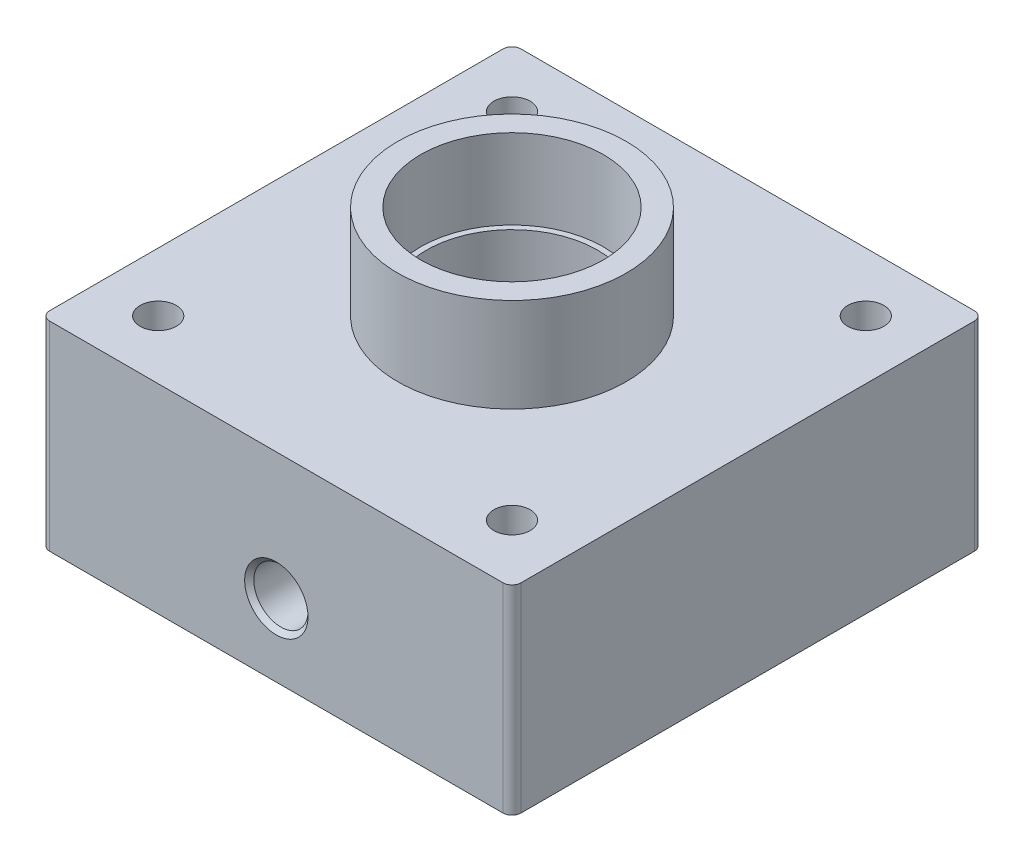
ISO-10303-21;
HEADER;
FILE_DESCRIPTION(('STEP AP214'),'2;1');
FILE_NAME('part.step','',(''),(''),'','','');
FILE_SCHEMA(('AUTOMOTIVE_DESIGN { 1 0 10303 214 1 1 1 1 }'));
ENDSEC;
DATA;
#1=APPLICATION_CONTEXT('core data for automotive mechanical design processes');
#2=APPLICATION_PROTOCOL_DEFINITION('international standard','automotive_design',2000,#1);
#3=PRODUCT_CONTEXT('',#1,'mechanical');
#4=PRODUCT('Part','Part','',(#3));
#5=PRODUCT_RELATED_PRODUCT_CATEGORY('part','',(#4));
#6=PRODUCT_DEFINITION_FORMATION('','',#4);
#7=PRODUCT_DEFINITION_CONTEXT('part definition',#1,'design');
#8=PRODUCT_DEFINITION('design','',#6,#7);
#9=PRODUCT_DEFINITION_SHAPE('','',#8);
#10=(LENGTH_UNIT() NAMED_UNIT(*) SI_UNIT(.MILLI.,.METRE.));
#11=(NAMED_UNIT(*) PLANE_ANGLE_UNIT() SI_UNIT($,.RADIAN.));
#12=(NAMED_UNIT(*) SI_UNIT($,.STERADIAN.) SOLID_ANGLE_UNIT());
#13=UNCERTAINTY_MEASURE_WITH_UNIT(LENGTH_MEASURE(1.E-05),#10,'distance_accuracy_value','');
#14=(GEOMETRIC_REPRESENTATION_CONTEXT(3) GLOBAL_UNCERTAINTY_ASSIGNED_CONTEXT((#13)) GLOBAL_UNIT_ASSIGNED_CONTEXT((#10,
#11,#12)) REPRESENTATION_CONTEXT('',''));
#15=CARTESIAN_POINT('',(0.,0.,0.));
#16=DIRECTION('',(0.,0.,1.));
#17=DIRECTION('',(1.,0.,0.));
#18=AXIS2_PLACEMENT_3D('',#15,#16,#17);
#19=CARTESIAN_POINT('',(82.55,50.8,-82.55));
#20=DIRECTION('',(-1.,0.,0.));
#21=DIRECTION('',(0.,0.,1.));
#22=AXIS2_PLACEMENT_3D('',#19,#20,#21);
#23=PLANE('',#22);
#24=DIRECTION('',(0.,0.,-1.));
#25=VECTOR('',#24,1.);
#26=CARTESIAN_POINT('',(82.55,0.,-82.55));
#27=LINE('',#26,#25);
#28=CARTESIAN_POINT('',(82.55,0.,79.375));
#29=VERTEX_POINT('',#28);
#30=CARTESIAN_POINT('',(82.55,0.,-79.375));
#31=VERTEX_POINT('',#30);
#32=EDGE_CURVE('E223',#29,#31,#27,.T.);
#33=ORIENTED_EDGE('',*,*,#32,.T.);
#34=DIRECTION('',(0.,-1.,0.));
#35=VECTOR('',#34,1.);
#36=CARTESIAN_POINT('',(82.55,50.8,-79.375));
#37=LINE('',#36,#35);
#38=CARTESIAN_POINT('',(82.55,69.85,-79.375));
#39=VERTEX_POINT('',#38);
#40=EDGE_CURVE('E120',#31,#39,#37,.F.);
#41=ORIENTED_EDGE('',*,*,#40,.T.);
#42=DIRECTION('',(0.,0.,-1.));
#43=VECTOR('',#42,1.);
#44=CARTESIAN_POINT('',(82.55,69.85,0.));
#45=LINE('',#44,#43);
#46=CARTESIAN_POINT('',(82.55,69.85,79.375));
#47=VERTEX_POINT('',#46);
#48=EDGE_CURVE('E124',#47,#39,#45,.T.);
#49=ORIENTED_EDGE('',*,*,#48,.F.);
#50=DIRECTION('',(0.,-1.,0.));
#51=VECTOR('',#50,1.);
#52=CARTESIAN_POINT('',(82.55,50.8,79.375));
#53=LINE('',#52,#51);
#54=EDGE_CURVE('E110',#47,#29,#53,.T.);
#55=ORIENTED_EDGE('',*,*,#54,.T.);
#56=EDGE_LOOP('',(#33,#41,#49,#55));
#57=FACE_BOUND('',#56,.T.);
#58=ADVANCED_FACE('F37',(#57),#23,.F.);
#59=CARTESIAN_POINT('',(-82.55,50.8,-82.55));
#60=DIRECTION('',(0.,0.,1.));
#61=DIRECTION('',(1.,0.,0.));
#62=AXIS2_PLACEMENT_3D('',#59,#60,#61);
#63=PLANE('',#62);
#64=DIRECTION('',(0.,-1.,0.));
#65=VECTOR('',#64,1.);
#66=CARTESIAN_POINT('',(-79.375,50.8,-82.55));
#67=LINE('',#66,#65);
#68=CARTESIAN_POINT('',(-79.375,0.,-82.55));
#69=VERTEX_POINT('',#68);
#70=CARTESIAN_POINT('',(-79.375,69.85,-82.55));
#71=VERTEX_POINT('',#70);
#72=EDGE_CURVE('E233',#69,#71,#67,.F.);
#73=ORIENTED_EDGE('',*,*,#72,.T.);
#74=DIRECTION('',(-1.,0.,0.));
#75=VECTOR('',#74,1.);
#76=CARTESIAN_POINT('',(0.,69.85,-82.55));
#77=LINE('',#76,#75);
#78=CARTESIAN_POINT('',(79.375,69.85,-82.55));
#79=VERTEX_POINT('',#78);
#80=EDGE_CURVE('E145',#79,#71,#77,.T.);
#81=ORIENTED_EDGE('',*,*,#80,.F.);
#82=DIRECTION('',(0.,-1.,0.));
#83=VECTOR('',#82,1.);
#84=CARTESIAN_POINT('',(79.375,50.8,-82.55));
#85=LINE('',#84,#83);
#86=CARTESIAN_POINT('',(79.375,0.,-82.55));
#87=VERTEX_POINT('',#86);
#88=EDGE_CURVE('E235',#79,#87,#85,.T.);
#89=ORIENTED_EDGE('',*,*,#88,.T.);
#90=DIRECTION('',(-1.,0.,0.));
#91=VECTOR('',#90,1.);
#92=CARTESIAN_POINT('',(-82.55,0.,-82.55));
#93=LINE('',#92,#91);
#94=EDGE_CURVE('E225',#87,#69,#93,.T.);
#95=ORIENTED_EDGE('',*,*,#94,.T.);
#96=EDGE_LOOP('',(#73,#81,#89,#95));
#97=FACE_BOUND('',#96,.T.);
#98=ADVANCED_FACE('F259',(#97),#63,.F.);
#99=CARTESIAN_POINT('',(-82.55,50.8,-82.55));
#100=DIRECTION('',(1.,0.,0.));
#101=DIRECTION('',(0.,0.,-1.));
#102=AXIS2_PLACEMENT_3D('',#99,#100,#101);
#103=PLANE('',#102);
#104=DIRECTION('',(0.,-1.,0.));
#105=VECTOR('',#104,1.);
#106=CARTESIAN_POINT('',(-82.55,50.8,79.375));
#107=LINE('',#106,#105);
#108=CARTESIAN_POINT('',(-82.55,0.,79.375));
#109=VERTEX_POINT('',#108);
#110=CARTESIAN_POINT('',(-82.55,69.85,79.375));
#111=VERTEX_POINT('',#110);
#112=EDGE_CURVE('E243',#109,#111,#107,.F.);
#113=ORIENTED_EDGE('',*,*,#112,.T.);
#114=DIRECTION('',(0.,0.,1.));
#115=VECTOR('',#114,1.);
#116=CARTESIAN_POINT('',(-82.55,69.85,0.));
#117=LINE('',#116,#115);
#118=CARTESIAN_POINT('',(-82.55,69.85,-79.375));
#119=VERTEX_POINT('',#118);
#120=EDGE_CURVE('E151',#119,#111,#117,.T.);
#121=ORIENTED_EDGE('',*,*,#120,.F.);
#122=DIRECTION('',(0.,-1.,0.));
#123=VECTOR('',#122,1.);
#124=CARTESIAN_POINT('',(-82.55,50.8,-79.375));
#125=LINE('',#124,#123);
#126=CARTESIAN_POINT('',(-82.55,0.,-79.375));
#127=VERTEX_POINT('',#126);
#128=EDGE_CURVE('E245',#119,#127,#125,.T.);
#129=ORIENTED_EDGE('',*,*,#128,.T.);
#130=DIRECTION('',(0.,0.,1.));
#131=VECTOR('',#130,1.);
#132=CARTESIAN_POINT('',(-82.55,0.,-82.55));
#133=LINE('',#132,#131);
#134=EDGE_CURVE('E228',#127,#109,#133,.T.);
#135=ORIENTED_EDGE('',*,*,#134,.T.);
#136=EDGE_LOOP('',(#113,#121,#129,#135));
#137=FACE_BOUND('',#136,.T.);
#138=ADVANCED_FACE('F263',(#137),#103,.F.);
#139=CARTESIAN_POINT('',(-82.55,50.8,82.55));
#140=DIRECTION('',(0.,0.,-1.));
#141=DIRECTION('',(-1.,0.,0.));
#142=AXIS2_PLACEMENT_3D('',#139,#140,#141);
#143=PLANE('',#142);
#144=CARTESIAN_POINT('',(0.,25.4,82.55));
#145=DIRECTION('',(0.,0.,1.));
#146=DIRECTION('',(1.,0.,0.));
#147=AXIS2_PLACEMENT_3D('',#144,#145,#146);
#148=CIRCLE('',#147,11.0871);
#149=CARTESIAN_POINT('',(11.0871,25.4,82.55));
#150=VERTEX_POINT('',#149);
#151=EDGE_CURVE('E181',#150,#150,#148,.T.);
#152=ORIENTED_EDGE('',*,*,#151,.F.);
#153=EDGE_LOOP('',(#152));
#154=FACE_BOUND('',#153,.T.);
#155=DIRECTION('',(1.,0.,0.));
#156=VECTOR('',#155,1.);
#157=CARTESIAN_POINT('',(-82.55,0.,82.55));
#158=LINE('',#157,#156);
#159=CARTESIAN_POINT('',(-79.375,0.,82.55));
#160=VERTEX_POINT('',#159);
#161=CARTESIAN_POINT('',(79.375,0.,82.55));
#162=VERTEX_POINT('',#161);
#163=EDGE_CURVE('E230',#160,#162,#158,.T.);
#164=ORIENTED_EDGE('',*,*,#163,.T.);
#165=DIRECTION('',(0.,-1.,0.));
#166=VECTOR('',#165,1.);
#167=CARTESIAN_POINT('',(79.375,50.8,82.55));
#168=LINE('',#167,#166);
#169=CARTESIAN_POINT('',(79.375,69.85,82.55));
#170=VERTEX_POINT('',#169);
#171=EDGE_CURVE('E11',#162,#170,#168,.F.);
#172=ORIENTED_EDGE('',*,*,#171,.T.);
#173=DIRECTION('',(1.,0.,0.));
#174=VECTOR('',#173,1.);
#175=CARTESIAN_POINT('',(0.,69.85,82.55));
#176=LINE('',#175,#174);
#177=CARTESIAN_POINT('',(-79.375,69.85,82.55));
#178=VERTEX_POINT('',#177);
#179=EDGE_CURVE('E136',#178,#170,#176,.T.);
#180=ORIENTED_EDGE('',*,*,#179,.F.);
#181=DIRECTION('',(0.,-1.,0.));
#182=VECTOR('',#181,1.);
#183=CARTESIAN_POINT('',(-79.375,50.8,82.55));
#184=LINE('',#183,#182);
#185=EDGE_CURVE('E50',#178,#160,#184,.T.);
#186=ORIENTED_EDGE('',*,*,#185,.T.);
#187=EDGE_LOOP('',(#164,#172,#180,#186));
#188=FACE_BOUND('',#187,.T.);
#189=ADVANCED_FACE('F249',(#154,#188),#143,.F.);
#190=CARTESIAN_POINT('',(0.,0.,0.));
#191=DIRECTION('',(0.,1.,0.));
#192=DIRECTION('',(0.,0.,1.));
#193=AXIS2_PLACEMENT_3D('',#190,#191,#192);
#194=PLANE('',#193);
#195=CARTESIAN_POINT('',(61.9637672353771,0.,61.9637672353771));
#196=DIRECTION('',(0.,-1.,0.));
#197=DIRECTION('',(0.,0.,-1.));
#198=AXIS2_PLACEMENT_3D('',#195,#196,#197);
#199=CIRCLE('',#198,6.35);
#200=CARTESIAN_POINT('',(61.9637672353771,0.,55.6137672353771));
#201=VERTEX_POINT('',#200);
#202=EDGE_CURVE('E167',#201,#201,#199,.T.);
#203=ORIENTED_EDGE('',*,*,#202,.F.);
#204=EDGE_LOOP('',(#203));
#205=FACE_BOUND('',#204,.T.);
#206=CARTESIAN_POINT('',(61.9637672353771,0.,-61.9637672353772));
#207=DIRECTION('',(0.,-1.,0.));
#208=DIRECTION('',(0.,0.,-1.));
#209=AXIS2_PLACEMENT_3D('',#206,#207,#208);
#210=CIRCLE('',#209,6.35);
#211=CARTESIAN_POINT('',(61.9637672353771,0.,-68.3137672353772));
#212=VERTEX_POINT('',#211);
#213=EDGE_CURVE('E171',#212,#212,#210,.T.);
#214=ORIENTED_EDGE('',*,*,#213,.F.);
#215=EDGE_LOOP('',(#214));
#216=FACE_BOUND('',#215,.T.);
#217=CARTESIAN_POINT('',(-61.9637672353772,0.,-61.9637672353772));
#218=DIRECTION('',(0.,-1.,0.));
#219=DIRECTION('',(0.,0.,-1.));
#220=AXIS2_PLACEMENT_3D('',#217,#218,#219);
#221=CIRCLE('',#220,6.35);
#222=CARTESIAN_POINT('',(-61.9637672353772,0.,-68.3137672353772));
#223=VERTEX_POINT('',#222);
#224=EDGE_CURVE('E166',#223,#223,#221,.T.);
#225=ORIENTED_EDGE('',*,*,#224,.F.);
#226=EDGE_LOOP('',(#225));
#227=FACE_BOUND('',#226,.T.);
#228=CARTESIAN_POINT('',(-61.9637672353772,0.,61.9637672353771));
#229=DIRECTION('',(0.,-1.,0.));
#230=DIRECTION('',(0.,0.,-1.));
#231=AXIS2_PLACEMENT_3D('',#228,#229,#230);
#232=CIRCLE('',#231,6.35);
#233=CARTESIAN_POINT('',(-61.9637672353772,0.,55.6137672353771));
#234=VERTEX_POINT('',#233);
#235=EDGE_CURVE('E170',#234,#234,#232,.T.);
#236=ORIENTED_EDGE('',*,*,#235,.F.);
#237=EDGE_LOOP('',(#236));
#238=FACE_BOUND('',#237,.T.);
#239=CARTESIAN_POINT('',(0.,0.,0.));
#240=DIRECTION('',(0.,-1.,0.));
#241=DIRECTION('',(0.,0.,-1.));
#242=AXIS2_PLACEMENT_3D('',#239,#240,#241);
#243=CIRCLE('',#242,76.2);
#244=CARTESIAN_POINT('',(0.,0.,-76.2));
#245=VERTEX_POINT('',#244);
#246=EDGE_CURVE('E194',#245,#245,#243,.T.);
#247=ORIENTED_EDGE('',*,*,#246,.F.);
#248=EDGE_LOOP('',(#247));
#249=FACE_BOUND('',#248,.T.);
#250=ORIENTED_EDGE('',*,*,#94,.F.);
#251=CARTESIAN_POINT('',(79.375,0.,-79.375));
#252=DIRECTION('',(0.,1.,0.));
#253=DIRECTION('',(0.,0.,1.));
#254=AXIS2_PLACEMENT_3D('',#251,#252,#253);
#255=CIRCLE('',#254,3.175);
#256=EDGE_CURVE('E121',#87,#31,#255,.F.);
#257=ORIENTED_EDGE('',*,*,#256,.T.);
#258=ORIENTED_EDGE('',*,*,#32,.F.);
#259=CARTESIAN_POINT('',(79.375,0.,79.375));
#260=DIRECTION('',(0.,1.,0.));
#261=DIRECTION('',(0.,0.,1.));
#262=AXIS2_PLACEMENT_3D('',#259,#260,#261);
#263=CIRCLE('',#262,3.175);
#264=EDGE_CURVE('E116',#29,#162,#263,.F.);
#265=ORIENTED_EDGE('',*,*,#264,.T.);
#266=ORIENTED_EDGE('',*,*,#163,.F.);
#267=CARTESIAN_POINT('',(-79.375,0.,79.375));
#268=DIRECTION('',(0.,1.,0.));
#269=DIRECTION('',(0.,0.,1.));
#270=AXIS2_PLACEMENT_3D('',#267,#268,#269);
#271=CIRCLE('',#270,3.175);
#272=EDGE_CURVE('E57',#160,#109,#271,.F.);
#273=ORIENTED_EDGE('',*,*,#272,.T.);
#274=ORIENTED_EDGE('',*,*,#134,.F.);
#275=CARTESIAN_POINT('',(-79.375,0.,-79.375));
#276=DIRECTION('',(0.,1.,0.));
#277=DIRECTION('',(0.,0.,1.));
#278=AXIS2_PLACEMENT_3D('',#275,#276,#277);
#279=CIRCLE('',#278,3.175);
#280=EDGE_CURVE('E65',#127,#69,#279,.F.);
#281=ORIENTED_EDGE('',*,*,#280,.T.);
#282=EDGE_LOOP('',(#250,#257,#258,#265,#266,#273,#274,#281));
#283=FACE_BOUND('',#282,.T.);
#284=ADVANCED_FACE('F253',(#205,#216,#227,#238,#249,#283),#194,.F.);
#285=CARTESIAN_POINT('',(79.375,50.8,-79.375));
#286=DIRECTION('',(0.,-1.,0.));
#287=DIRECTION('',(0.,0.,-1.));
#288=AXIS2_PLACEMENT_3D('',#285,#286,#287);
#289=CYLINDRICAL_SURFACE('',#288,3.175);
#290=ORIENTED_EDGE('',*,*,#88,.F.);
#291=CARTESIAN_POINT('',(79.375,69.85,-79.375));
#292=DIRECTION('',(0.,1.,0.));
#293=DIRECTION('',(0.,0.,1.));
#294=AXIS2_PLACEMENT_3D('',#291,#292,#293);
#295=CIRCLE('',#294,3.175);
#296=EDGE_CURVE('E129',#39,#79,#295,.T.);
#297=ORIENTED_EDGE('',*,*,#296,.F.);
#298=ORIENTED_EDGE('',*,*,#40,.F.);
#299=ORIENTED_EDGE('',*,*,#256,.F.);
#300=EDGE_LOOP('',(#290,#297,#298,#299));
#301=FACE_BOUND('',#300,.T.);
#302=ADVANCED_FACE('F255',(#301),#289,.T.);
#303=CARTESIAN_POINT('',(-79.375,50.8,-79.375));
#304=DIRECTION('',(0.,-1.,0.));
#305=DIRECTION('',(0.,0.,-1.));
#306=AXIS2_PLACEMENT_3D('',#303,#304,#305);
#307=CYLINDRICAL_SURFACE('',#306,3.175);
#308=ORIENTED_EDGE('',*,*,#128,.F.);
#309=CARTESIAN_POINT('',(-79.375,69.85,-79.375));
#310=DIRECTION('',(0.,1.,0.));
#311=DIRECTION('',(0.,0.,1.));
#312=AXIS2_PLACEMENT_3D('',#309,#310,#311);
#313=CIRCLE('',#312,3.175);
#314=EDGE_CURVE('E148',#71,#119,#313,.T.);
#315=ORIENTED_EDGE('',*,*,#314,.F.);
#316=ORIENTED_EDGE('',*,*,#72,.F.);
#317=ORIENTED_EDGE('',*,*,#280,.F.);
#318=EDGE_LOOP('',(#308,#315,#316,#317));
#319=FACE_BOUND('',#318,.T.);
#320=ADVANCED_FACE('F260',(#319),#307,.T.);
#321=CARTESIAN_POINT('',(79.375,50.8,79.375));
#322=DIRECTION('',(0.,-1.,0.));
#323=DIRECTION('',(0.,0.,-1.));
#324=AXIS2_PLACEMENT_3D('',#321,#322,#323);
#325=CYLINDRICAL_SURFACE('',#324,3.175);
#326=ORIENTED_EDGE('',*,*,#54,.F.);
#327=CARTESIAN_POINT('',(79.375,69.85,79.375));
#328=DIRECTION('',(0.,1.,0.));
#329=DIRECTION('',(0.,0.,1.));
#330=AXIS2_PLACEMENT_3D('',#327,#328,#329);
#331=CIRCLE('',#330,3.175);
#332=EDGE_CURVE('E115',#170,#47,#331,.T.);
#333=ORIENTED_EDGE('',*,*,#332,.F.);
#334=ORIENTED_EDGE('',*,*,#171,.F.);
#335=ORIENTED_EDGE('',*,*,#264,.F.);
#336=EDGE_LOOP('',(#326,#333,#334,#335));
#337=FACE_BOUND('',#336,.T.);
#338=ADVANCED_FACE('F112',(#337),#325,.T.);
#339=CARTESIAN_POINT('',(-79.375,50.8,79.375));
#340=DIRECTION('',(0.,-1.,0.));
#341=DIRECTION('',(0.,0.,-1.));
#342=AXIS2_PLACEMENT_3D('',#339,#340,#341);
#343=CYLINDRICAL_SURFACE('',#342,3.175);
#344=ORIENTED_EDGE('',*,*,#185,.F.);
#345=CARTESIAN_POINT('',(-79.375,69.85,79.375));
#346=DIRECTION('',(0.,1.,0.));
#347=DIRECTION('',(0.,0.,1.));
#348=AXIS2_PLACEMENT_3D('',#345,#346,#347);
#349=CIRCLE('',#348,3.175);
#350=EDGE_CURVE('E154',#111,#178,#349,.T.);
#351=ORIENTED_EDGE('',*,*,#350,.F.);
#352=ORIENTED_EDGE('',*,*,#112,.F.);
#353=ORIENTED_EDGE('',*,*,#272,.F.);
#354=EDGE_LOOP('',(#344,#351,#352,#353));
#355=FACE_BOUND('',#354,.T.);
#356=ADVANCED_FACE('F39',(#355),#343,.T.);
#357=CARTESIAN_POINT('',(0.,8.,0.));
#358=DIRECTION('',(0.,-1.,0.));
#359=DIRECTION('',(0.,0.,-1.));
#360=AXIS2_PLACEMENT_3D('',#357,#358,#359);
#361=CYLINDRICAL_SURFACE('',#360,76.2);
#362=CARTESIAN_POINT('',(0.,8.,0.));
#363=DIRECTION('',(0.,-1.,0.));
#364=DIRECTION('',(0.,0.,-1.));
#365=AXIS2_PLACEMENT_3D('',#362,#363,#364);
#366=CIRCLE('',#365,76.2);
#367=CARTESIAN_POINT('',(0.,8.,-76.2));
#368=VERTEX_POINT('',#367);
#369=EDGE_CURVE('E197',#368,#368,#366,.T.);
#370=ORIENTED_EDGE('',*,*,#369,.F.);
#371=EDGE_LOOP('',(#370));
#372=FACE_BOUND('',#371,.T.);
#373=ORIENTED_EDGE('',*,*,#246,.T.);
#374=EDGE_LOOP('',(#373));
#375=FACE_BOUND('',#374,.T.);
#376=ADVANCED_FACE('F266',(#372,#375),#361,.F.);
#377=CARTESIAN_POINT('',(0.,8.,0.));
#378=DIRECTION('',(0.,-1.,0.));
#379=DIRECTION('',(0.,0.,-1.));
#380=AXIS2_PLACEMENT_3D('',#377,#378,#379);
#381=PLANE('',#380);
#382=CARTESIAN_POINT('',(0.,8.,0.));
#383=DIRECTION('',(0.,-1.,0.));
#384=DIRECTION('',(0.,0.,-1.));
#385=AXIS2_PLACEMENT_3D('',#382,#383,#384);
#386=CIRCLE('',#385,69.85);
#387=CARTESIAN_POINT('',(0.,8.,-69.85));
#388=VERTEX_POINT('',#387);
#389=EDGE_CURVE('E191',#388,#388,#386,.T.);
#390=ORIENTED_EDGE('',*,*,#389,.F.);
#391=EDGE_LOOP('',(#390));
#392=FACE_BOUND('',#391,.T.);
#393=ORIENTED_EDGE('',*,*,#369,.T.);
#394=EDGE_LOOP('',(#393));
#395=FACE_BOUND('',#394,.T.);
#396=ADVANCED_FACE('F271',(#392,#395),#381,.T.);
#397=CARTESIAN_POINT('',(0.,8.,0.));
#398=DIRECTION('',(0.,-1.,0.));
#399=DIRECTION('',(0.,0.,-1.));
#400=AXIS2_PLACEMENT_3D('',#397,#398,#399);
#401=CYLINDRICAL_SURFACE('',#400,69.85);
#402=ORIENTED_EDGE('',*,*,#389,.T.);
#403=EDGE_LOOP('',(#402));
#404=FACE_BOUND('',#403,.T.);
#405=CARTESIAN_POINT('',(0.,0.,0.));
#406=DIRECTION('',(0.,-1.,0.));
#407=DIRECTION('',(0.,0.,-1.));
#408=AXIS2_PLACEMENT_3D('',#405,#406,#407);
#409=CIRCLE('',#408,69.85);
#410=CARTESIAN_POINT('',(0.,0.,-69.85));
#411=VERTEX_POINT('',#410);
#412=EDGE_CURVE('E190',#411,#411,#409,.T.);
#413=ORIENTED_EDGE('',*,*,#412,.F.);
#414=EDGE_LOOP('',(#413));
#415=FACE_BOUND('',#414,.T.);
#416=ADVANCED_FACE('F431',(#404,#415),#401,.T.);
#417=CARTESIAN_POINT('',(0.,40.,0.));
#418=DIRECTION('',(0.,-1.,0.));
#419=DIRECTION('',(0.,0.,-1.));
#420=AXIS2_PLACEMENT_3D('',#417,#418,#419);
#421=PLANE('',#420);
#422=CARTESIAN_POINT('',(0.,40.,0.));
#423=DIRECTION('',(0.,-1.,0.));
#424=DIRECTION('',(0.,0.,-1.));
#425=AXIS2_PLACEMENT_3D('',#422,#423,#424);
#426=CIRCLE('',#425,20.);
#427=CARTESIAN_POINT('',(0.,40.,-20.));
#428=VERTEX_POINT('',#427);
#429=EDGE_CURVE('E203',#428,#428,#426,.T.);
#430=ORIENTED_EDGE('',*,*,#429,.T.);
#431=EDGE_LOOP('',(#430));
#432=FACE_BOUND('',#431,.T.);
#433=ADVANCED_FACE('F420',(#432),#421,.T.);
#434=CARTESIAN_POINT('',(0.,40.,0.));
#435=DIRECTION('',(0.,-1.,0.));
#436=DIRECTION('',(0.,0.,-1.));
#437=AXIS2_PLACEMENT_3D('',#434,#435,#436);
#438=CYLINDRICAL_SURFACE('',#437,20.);
#439=ORIENTED_EDGE('',*,*,#429,.F.);
#440=EDGE_LOOP('',(#439));
#441=FACE_BOUND('',#440,.T.);
#442=CARTESIAN_POINT('',(0.,0.,0.));
#443=DIRECTION('',(0.,-1.,0.));
#444=DIRECTION('',(0.,0.,-1.));
#445=AXIS2_PLACEMENT_3D('',#442,#443,#444);
#446=CIRCLE('',#445,20.);
#447=CARTESIAN_POINT('',(0.,0.,-20.));
#448=VERTEX_POINT('',#447);
#449=EDGE_CURVE('E200',#448,#448,#446,.T.);
#450=ORIENTED_EDGE('',*,*,#449,.T.);
#451=EDGE_LOOP('',(#450));
#452=FACE_BOUND('',#451,.T.);
#453=ADVANCED_FACE('F414',(#441,#452),#438,.F.);
#454=CARTESIAN_POINT('',(0.,0.,50.55));
#455=DIRECTION('',(0.,-1.,0.));
#456=DIRECTION('',(0.,0.,-1.));
#457=AXIS2_PLACEMENT_3D('',#454,#455,#456);
#458=CIRCLE('',#457,6.35);
#459=CARTESIAN_POINT('',(0.,0.,44.2));
#460=VERTEX_POINT('',#459);
#461=EDGE_CURVE('E178',#460,#460,#458,.T.);
#462=ORIENTED_EDGE('',*,*,#461,.F.);
#463=EDGE_LOOP('',(#462));
#464=FACE_BOUND('',#463,.T.);
#465=ORIENTED_EDGE('',*,*,#449,.F.);
#466=EDGE_LOOP('',(#465));
#467=FACE_BOUND('',#466,.T.);
#468=ORIENTED_EDGE('',*,*,#412,.T.);
#469=EDGE_LOOP('',(#468));
#470=FACE_BOUND('',#469,.T.);
#471=ADVANCED_FACE('F419',(#464,#467,#470),#194,.F.);
#472=CARTESIAN_POINT('',(0.,25.4,35.31));
#473=DIRECTION('',(0.,0.,1.));
#474=DIRECTION('',(1.,0.,0.));
#475=AXIS2_PLACEMENT_3D('',#472,#473,#474);
#476=CONICAL_SURFACE('',#475,9.48689999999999,1.02974425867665);
#477=CARTESIAN_POINT('',(0.,25.4,29.6096953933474));
#478=VERTEX_POINT('',#477);
#479=VERTEX_LOOP('',#478);
#480=FACE_BOUND('',#479,.T.);
#481=CARTESIAN_POINT('',(0.,25.4,35.31));
#482=DIRECTION('',(0.,0.,1.));
#483=DIRECTION('',(1.,0.,0.));
#484=AXIS2_PLACEMENT_3D('',#481,#482,#483);
#485=CIRCLE('',#484,9.48689999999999);
#486=CARTESIAN_POINT('',(9.48689999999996,25.4,35.31));
#487=VERTEX_POINT('',#486);
#488=EDGE_CURVE('E187',#487,#487,#485,.T.);
#489=ORIENTED_EDGE('',*,*,#488,.T.);
#490=EDGE_LOOP('',(#489));
#491=FACE_BOUND('',#490,.T.);
#492=ADVANCED_FACE('F463',(#480,#491),#476,.F.);
#493=CARTESIAN_POINT('',(0.,25.4,82.55));
#494=DIRECTION('',(0.,0.,1.));
#495=DIRECTION('',(1.,0.,0.));
#496=AXIS2_PLACEMENT_3D('',#493,#494,#495);
#497=CYLINDRICAL_SURFACE('',#496,9.48689999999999);
#498=CARTESIAN_POINT('',(0.,15.9131,44.2));
#499=CARTESIAN_POINT('',(0.159397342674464,15.9130998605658,44.1999998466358));
#500=CARTESIAN_POINT('',(0.318792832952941,15.9171256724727,44.2060096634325));
#501=CARTESIAN_POINT('',(0.636277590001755,15.9331269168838,44.2299530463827));
#502=CARTESIAN_POINT('',(0.794366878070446,15.9451022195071,44.2478864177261));
#503=CARTESIAN_POINT('',(1.10805497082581,15.9767125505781,44.2954105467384));
#504=CARTESIAN_POINT('',(1.26365289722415,15.9963502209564,44.3250053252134));
#505=CARTESIAN_POINT('',(1.57117941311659,16.0428179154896,44.3954257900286));
#506=CARTESIAN_POINT('',(1.72310793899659,16.0696480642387,44.4362516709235));
#507=CARTESIAN_POINT('',(2.02158359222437,16.1297505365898,44.5283749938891));
#508=CARTESIAN_POINT('',(2.16815372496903,16.1629901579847,44.5796193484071));
#509=CARTESIAN_POINT('',(2.45593784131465,16.2353016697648,44.6921188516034));
#510=CARTESIAN_POINT('',(2.59714971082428,16.2743758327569,44.7533779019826));
#511=CARTESIAN_POINT('',(3.01162600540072,16.3991982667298,44.9512318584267));
#512=CARTESIAN_POINT('',(3.27598763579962,16.492600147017,45.1019840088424));
#513=CARTESIAN_POINT('',(3.79819657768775,16.7016745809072,45.45066508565));
#514=CARTESIAN_POINT('',(4.05357222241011,16.8185662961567,45.6515181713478));
#515=CARTESIAN_POINT('',(4.5294605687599,17.0599493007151,46.0878435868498));
#516=CARTESIAN_POINT('',(4.74992210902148,17.1844513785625,46.3233657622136));
#517=CARTESIAN_POINT('',(5.06838993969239,17.3793054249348,46.7200176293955));
#518=CARTESIAN_POINT('',(5.17894171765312,17.4504412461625,46.8708533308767));
#519=CARTESIAN_POINT('',(5.38686396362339,17.5898367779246,47.182604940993));
#520=CARTESIAN_POINT('',(5.4842314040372,17.6580958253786,47.3435231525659));
#521=CARTESIAN_POINT('',(5.75519977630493,17.8549013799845,47.8403656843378));
#522=CARTESIAN_POINT('',(5.90831448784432,17.975892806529,48.1911792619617));
#523=CARTESIAN_POINT('',(6.11558553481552,18.1464788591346,48.8187617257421));
#524=CARTESIAN_POINT('',(6.185568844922,18.2066038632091,49.0874229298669));
#525=CARTESIAN_POINT('',(6.26394793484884,18.2750181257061,49.4988226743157));
#526=CARTESIAN_POINT('',(6.28563821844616,18.2941906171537,49.6372990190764));
#527=CARTESIAN_POINT('',(6.31985887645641,18.3246059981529,49.9162718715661));
#528=CARTESIAN_POINT('',(6.33238920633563,18.3358488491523,50.0567683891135));
#529=CARTESIAN_POINT('',(6.3480875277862,18.3499527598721,50.3393067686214));
#530=CARTESIAN_POINT('',(6.35121544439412,18.3527779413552,50.4813526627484));
#531=CARTESIAN_POINT('',(6.34793844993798,18.3498259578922,50.7652432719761));
#532=CARTESIAN_POINT('',(6.34153350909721,18.3440487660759,50.907087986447));
#533=CARTESIAN_POINT('',(6.31930264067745,18.3241320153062,51.1895202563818));
#534=CARTESIAN_POINT('',(6.30347160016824,18.3099879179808,51.3301070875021));
#535=CARTESIAN_POINT('',(6.26266708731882,18.2739210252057,51.608957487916));
#536=CARTESIAN_POINT('',(6.2376897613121,18.2519949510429,51.7472200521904));
#537=CARTESIAN_POINT('',(6.15230685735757,18.1780931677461,52.1445431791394));
#538=CARTESIAN_POINT('',(6.08030975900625,18.1168943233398,52.3995006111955));
#539=CARTESIAN_POINT('',(5.90746146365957,17.9760180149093,52.8937488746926));
#540=CARTESIAN_POINT('',(5.80660075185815,17.896334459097,53.133034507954));
#541=CARTESIAN_POINT('',(5.5553383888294,17.7078681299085,53.6413906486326));
#542=CARTESIAN_POINT('',(5.39902555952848,17.5964661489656,53.9065609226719));
#543=CARTESIAN_POINT('',(5.05133419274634,17.3670232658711,54.4100851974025));
#544=CARTESIAN_POINT('',(4.85991231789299,17.2489742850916,54.6484054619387));
#545=CARTESIAN_POINT('',(4.52545921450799,17.0607729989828,55.0084039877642));
#546=CARTESIAN_POINT('',(4.39265348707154,16.9898886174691,55.1393360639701));
#547=CARTESIAN_POINT('',(4.11528428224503,16.8507457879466,55.3896084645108));
#548=CARTESIAN_POINT('',(3.97072427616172,16.7824865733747,55.5089521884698));
#549=CARTESIAN_POINT('',(3.67039935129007,16.6503514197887,55.7351707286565));
#550=CARTESIAN_POINT('',(3.5146398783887,16.5864733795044,55.8420515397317));
#551=CARTESIAN_POINT('',(3.19250738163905,16.4647446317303,56.0423898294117));
#552=CARTESIAN_POINT('',(3.02613728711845,16.4068922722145,56.1358509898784));
#553=CARTESIAN_POINT('',(2.7171491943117,16.3093865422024,56.2913755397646));
#554=CARTESIAN_POINT('',(2.57624295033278,16.2683860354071,56.3560055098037));
#555=CARTESIAN_POINT('',(2.28875620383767,16.1921246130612,56.4752255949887));
#556=CARTESIAN_POINT('',(2.14217686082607,16.1568625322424,56.5298177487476));
#557=CARTESIAN_POINT('',(1.84419097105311,16.0928286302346,56.628327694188));
#558=CARTESIAN_POINT('',(1.69278753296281,16.0640527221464,56.6722522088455));
#559=CARTESIAN_POINT('',(1.38600075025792,16.0136036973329,56.7489109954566));
#560=CARTESIAN_POINT('',(1.23061734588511,15.9919306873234,56.7816450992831));
#561=CARTESIAN_POINT('',(0.916270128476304,15.9561208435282,56.8355780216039));
#562=CARTESIAN_POINT('',(0.757293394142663,15.9420182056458,56.8567245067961));
#563=CARTESIAN_POINT('',(0.437684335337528,15.9218492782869,56.8869311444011));
#564=CARTESIAN_POINT('',(0.277052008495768,15.9157830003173,56.8959912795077));
#565=CARTESIAN_POINT('',(-0.0445287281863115,15.9118418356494,56.9018799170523));
#566=CARTESIAN_POINT('',(-0.205477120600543,15.9139665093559,56.8987090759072));
#567=CARTESIAN_POINT('',(-0.526349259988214,15.926352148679,56.8801879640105));
#568=CARTESIAN_POINT('',(-0.686273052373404,15.9366127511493,56.8648382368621));
#569=CARTESIAN_POINT('',(-0.992302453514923,15.9639797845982,56.8237485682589));
#570=CARTESIAN_POINT('',(-1.1385703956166,15.98053695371,56.7988410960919));
#571=CARTESIAN_POINT('',(-1.42821827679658,16.0200832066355,56.739068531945));
#572=CARTESIAN_POINT('',(-1.57159721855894,16.0430744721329,56.7042000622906));
#573=CARTESIAN_POINT('',(-1.85453851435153,16.0950210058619,56.6249288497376));
#574=CARTESIAN_POINT('',(-1.99410199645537,16.1239744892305,56.5805289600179));
#575=CARTESIAN_POINT('',(-2.26876931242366,16.1872988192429,56.4826615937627));
#576=CARTESIAN_POINT('',(-2.40387140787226,16.2216717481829,56.4291906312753));
#577=CARTESIAN_POINT('',(-2.81706870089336,16.3363371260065,56.2491389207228));
#578=CARTESIAN_POINT('',(-3.08648051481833,16.4250657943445,56.1075633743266));
#579=CARTESIAN_POINT('',(-3.59845444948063,16.6177742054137,55.7906607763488));
#580=CARTESIAN_POINT('',(-3.84100030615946,16.7217630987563,55.6153134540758));
#581=CARTESIAN_POINT('',(-4.33316185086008,16.9554529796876,55.2045268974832));
#582=CARTESIAN_POINT('',(-4.5778104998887,17.0866174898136,54.963968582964));
#583=CARTESIAN_POINT('',(-5.02557796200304,17.3493971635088,54.4465626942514));
#584=CARTESIAN_POINT('',(-5.22866625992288,17.4810125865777,54.1696886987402));
#585=CARTESIAN_POINT('',(-5.4922011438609,17.6638950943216,53.7411464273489));
#586=CARTESIAN_POINT('',(-5.5705453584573,17.7202451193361,53.6023955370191));
#587=CARTESIAN_POINT('',(-5.71717675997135,17.8287740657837,53.3180279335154));
#588=CARTESIAN_POINT('',(-5.78546268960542,17.8809524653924,53.1724103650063));
#589=CARTESIAN_POINT('',(-5.91128232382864,17.9794611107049,52.87492792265));
#590=CARTESIAN_POINT('',(-5.96883009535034,18.0257989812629,52.7230715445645));
#591=CARTESIAN_POINT('',(-6.0725805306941,18.1109982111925,52.4135644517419));
#592=CARTESIAN_POINT('',(-6.11879047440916,18.1498643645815,52.2559175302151));
#593=CARTESIAN_POINT('',(-6.1917610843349,18.2121474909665,51.9651791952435));
#594=CARTESIAN_POINT('',(-6.2205368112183,18.2370916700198,51.8329189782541));
#595=CARTESIAN_POINT('',(-6.26969621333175,18.2800806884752,51.5657934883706));
#596=CARTESIAN_POINT('',(-6.29008410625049,18.2981289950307,51.430929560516));
#597=CARTESIAN_POINT('',(-6.32215946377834,18.3266673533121,51.1594771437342));
#598=CARTESIAN_POINT('',(-6.33385368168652,18.3371632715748,51.0228900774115));
#599=CARTESIAN_POINT('',(-6.3483682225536,18.3502064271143,50.7488595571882));
#600=CARTESIAN_POINT('',(-6.35118842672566,18.3527535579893,50.6114160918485));
#601=CARTESIAN_POINT('',(-6.34790227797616,18.3497934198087,50.3366125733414));
#602=CARTESIAN_POINT('',(-6.34178869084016,18.3442796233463,50.1992526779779));
#603=CARTESIAN_POINT('',(-6.32073108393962,18.325409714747,49.9257637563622));
#604=CARTESIAN_POINT('',(-6.30578713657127,18.3120536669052,49.7896347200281));
#605=CARTESIAN_POINT('',(-6.26729832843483,18.2779988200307,49.5194096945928));
#606=CARTESIAN_POINT('',(-6.24374555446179,18.2572932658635,49.3853156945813));
#607=CARTESIAN_POINT('',(-6.18837293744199,18.2092662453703,49.1199916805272));
#608=CARTESIAN_POINT('',(-6.15654835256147,18.1819409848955,48.988763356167));
#609=CARTESIAN_POINT('',(-6.07568005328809,18.1136519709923,48.6960036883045));
#610=CARTESIAN_POINT('',(-6.0243099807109,18.0709900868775,48.535508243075));
#611=CARTESIAN_POINT('',(-5.90982133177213,17.9783625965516,48.2209321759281));
#612=CARTESIAN_POINT('',(-5.84669850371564,17.9283943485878,48.0668539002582));
#613=CARTESIAN_POINT('',(-5.70933843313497,17.8229147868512,47.7655080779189));
#614=CARTESIAN_POINT('',(-5.63508976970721,17.76739779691,47.6182477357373));
#615=CARTESIAN_POINT('',(-5.47615134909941,17.652569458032,47.331116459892));
#616=CARTESIAN_POINT('',(-5.3914621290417,17.5932583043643,47.1912451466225));
#617=CARTESIAN_POINT('',(-5.11903350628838,17.4096873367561,46.7779781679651));
#618=CARTESIAN_POINT('',(-4.91541018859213,17.2817827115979,46.5163302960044));
#619=CARTESIAN_POINT('',(-4.58126649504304,17.0915809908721,46.1497869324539));
#620=CARTESIAN_POINT('',(-4.46504023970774,17.0284275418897,46.0318788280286));
#621=CARTESIAN_POINT('',(-4.22317251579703,16.9038504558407,45.8050245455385));
#622=CARTESIAN_POINT('',(-4.09752961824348,16.8424270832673,45.6960797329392));
#623=CARTESIAN_POINT('',(-3.8174933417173,16.7135023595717,45.4719995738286));
#624=CARTESIAN_POINT('',(-3.6616258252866,16.6464869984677,45.3584204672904));
#625=CARTESIAN_POINT('',(-3.3385779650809,16.5182575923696,45.145016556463));
#626=CARTESIAN_POINT('',(-3.17140247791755,16.4570410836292,45.0451859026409));
#627=CARTESIAN_POINT('',(-2.82667978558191,16.3421784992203,44.8604847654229));
#628=CARTESIAN_POINT('',(-2.64914136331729,16.2885261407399,44.7756018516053));
#629=CARTESIAN_POINT('',(-2.28479099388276,16.1904095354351,44.621991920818));
#630=CARTESIAN_POINT('',(-2.09798210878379,16.1459422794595,44.5532596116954));
#631=CARTESIAN_POINT('',(-1.75516881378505,16.0755797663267,44.4453006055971));
#632=CARTESIAN_POINT('',(-1.60054821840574,16.0477476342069,44.402918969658));
#633=CARTESIAN_POINT('',(-1.28745114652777,15.9995313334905,44.3298072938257));
#634=CARTESIAN_POINT('',(-1.12897548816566,15.9791455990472,44.2990748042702));
#635=CARTESIAN_POINT('',(-0.809439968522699,15.9463310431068,44.2497282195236));
#636=CARTESIAN_POINT('',(-0.648381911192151,15.9338968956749,44.2311060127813));
#637=CARTESIAN_POINT('',(-0.324881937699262,15.9172814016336,44.2062419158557));
#638=CARTESIAN_POINT('',(-0.162440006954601,15.9131001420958,44.2000001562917));
#639=CARTESIAN_POINT('',(0.,15.9131,44.2));
#640=B_SPLINE_CURVE_WITH_KNOTS('',3,(#498,#499,#500,#501,#502,#503,#504,#505,#506,#507,#508,
#509,#510,#511,#512,#513,#514,#515,#516,#517,#518,#519,#520,#521,#522,#523,#524,#525,#526,#527,
#528,#529,#530,#531,#532,#533,#534,#535,#536,#537,#538,#539,#540,#541,#542,#543,#544,#545,#546,
#547,#548,#549,#550,#551,#552,#553,#554,#555,#556,#557,#558,#559,#560,#561,#562,#563,#564,#565,
#566,#567,#568,#569,#570,#571,#572,#573,#574,#575,#576,#577,#578,#579,#580,#581,#582,#583,#584,
#585,#586,#587,#588,#589,#590,#591,#592,#593,#594,#595,#596,#597,#598,#599,#600,#601,#602,#603,
#604,#605,#606,#607,#608,#609,#610,#611,#612,#613,#614,#615,#616,#617,#618,#619,#620,#621,#622,
#623,#624,#625,#626,#627,#628,#629,#630,#631,#632,#633,#634,#635,#636,#637,#638,#639),
.UNSPECIFIED.,.T.,.F.,(4,2,2,2,2,2,2,2,2,2,2,2,2,2,2,2,2,2,2,2,2,2,2,2,2,2,2,2,2,2,2,2,2,2,2,2,
2,2,2,2,2,2,2,2,2,2,2,2,2,2,2,2,2,2,2,2,2,2,2,2,2,2,2,2,2,2,2,2,2,2,4),(0.,0.478026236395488,
0.956044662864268,1.4342280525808,1.91241972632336,2.38823322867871,2.86423255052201,
3.81541787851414,4.84760056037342,5.88128202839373,6.48087823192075,7.08061189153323,
8.27678620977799,9.12535744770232,9.54929717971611,9.97323897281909,10.3989851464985,
10.8247326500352,11.2507112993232,11.6768696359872,12.4893087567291,13.3020160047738,
14.2807337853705,15.2606678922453,15.8585968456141,16.4563498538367,17.0538141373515,
17.6511141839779,18.1316915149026,18.6121711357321,19.0923471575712,19.5725303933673,
20.0548647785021,20.537199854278,21.0195090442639,21.5017967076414,21.9491759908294,
22.3967071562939,22.8441045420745,23.2916742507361,24.2387316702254,25.1863593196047,
26.2841086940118,27.3826612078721,27.8893123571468,28.396026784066,28.902072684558,
29.4077928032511,29.8202776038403,30.2325547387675,30.6445112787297,31.056473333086,
31.4687691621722,31.8810616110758,32.2937339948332,32.7066434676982,33.2273826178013,
33.7483105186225,34.2697768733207,34.791216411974,35.8527194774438,36.3839612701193,
36.915283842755,37.5269744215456,38.1384039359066,38.749322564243,39.360040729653,
39.8476160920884,40.3350888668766,40.8222347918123,41.3093858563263),.UNSPECIFIED.);
#641=CARTESIAN_POINT('',(0.,15.9131,44.2));
#642=VERTEX_POINT('',#641);
#643=EDGE_CURVE('E41',#642,#642,#640,.T.);
#644=ORIENTED_EDGE('',*,*,#643,.T.);
#645=EDGE_LOOP('',(#644));
#646=FACE_BOUND('',#645,.T.);
#647=ORIENTED_EDGE('',*,*,#488,.F.);
#648=EDGE_LOOP('',(#647));
#649=FACE_BOUND('',#648,.T.);
#650=CARTESIAN_POINT('',(0.,25.4,80.9498));
#651=DIRECTION('',(0.,0.,1.));
#652=DIRECTION('',(1.,0.,0.));
#653=AXIS2_PLACEMENT_3D('',#650,#651,#652);
#654=CIRCLE('',#653,9.4869);
#655=CARTESIAN_POINT('',(9.48689999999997,25.4,80.9498));
#656=VERTEX_POINT('',#655);
#657=EDGE_CURVE('E184',#656,#656,#654,.T.);
#658=ORIENTED_EDGE('',*,*,#657,.T.);
#659=EDGE_LOOP('',(#658));
#660=FACE_BOUND('',#659,.T.);
#661=ADVANCED_FACE('F467',(#646,#649,#660),#497,.F.);
#662=CARTESIAN_POINT('',(0.,25.4,82.55));
#663=DIRECTION('',(0.,0.,1.));
#664=DIRECTION('',(1.,0.,0.));
#665=AXIS2_PLACEMENT_3D('',#662,#663,#664);
#666=CONICAL_SURFACE('',#665,11.0871,0.785398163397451);
#667=ORIENTED_EDGE('',*,*,#657,.F.);
#668=EDGE_LOOP('',(#667));
#669=FACE_BOUND('',#668,.T.);
#670=ORIENTED_EDGE('',*,*,#151,.T.);
#671=EDGE_LOOP('',(#670));
#672=FACE_BOUND('',#671,.T.);
#673=ADVANCED_FACE('F475',(#669,#672),#666,.F.);
#674=CARTESIAN_POINT('',(0.,25.,50.55));
#675=DIRECTION('',(0.,-1.,0.));
#676=DIRECTION('',(0.,0.,-1.));
#677=AXIS2_PLACEMENT_3D('',#674,#675,#676);
#678=CYLINDRICAL_SURFACE('',#677,6.35);
#679=ORIENTED_EDGE('',*,*,#461,.T.);
#680=EDGE_LOOP('',(#679));
#681=FACE_BOUND('',#680,.T.);
#682=ORIENTED_EDGE('',*,*,#643,.F.);
#683=EDGE_LOOP('',(#682));
#684=FACE_BOUND('',#683,.T.);
#685=ADVANCED_FACE('F312',(#681,#684),#678,.F.);
#686=CARTESIAN_POINT('',(-61.9637672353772,102.8,61.9637672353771));
#687=DIRECTION('',(0.,-1.,0.));
#688=DIRECTION('',(0.,0.,-1.));
#689=AXIS2_PLACEMENT_3D('',#686,#687,#688);
#690=CYLINDRICAL_SURFACE('',#689,6.35);
#691=CARTESIAN_POINT('',(-61.9637672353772,69.85,61.9637672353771));
#692=DIRECTION('',(0.,1.,0.));
#693=DIRECTION('',(0.,0.,1.));
#694=AXIS2_PLACEMENT_3D('',#691,#692,#693);
#695=CIRCLE('',#694,6.35);
#696=CARTESIAN_POINT('',(-61.9637672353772,69.85,55.6137672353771));
#697=VERTEX_POINT('',#696);
#698=EDGE_CURVE('E137',#697,#697,#695,.F.);
#699=CARTESIAN_POINT('',(-61.9637672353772,0.,55.6137672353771));
#700=CARTESIAN_POINT('',(-61.9637672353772,0.727604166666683,55.6137672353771));
#701=CARTESIAN_POINT('',(-61.9637672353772,1.45520833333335,55.6137672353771));
#702=CARTESIAN_POINT('',(-61.9637672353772,2.91041666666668,55.6137672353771));
#703=CARTESIAN_POINT('',(-61.9637672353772,3.63802083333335,55.6137672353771));
#704=CARTESIAN_POINT('',(-61.9637672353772,5.09322916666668,55.6137672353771));
#705=CARTESIAN_POINT('',(-61.9637672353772,5.82083333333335,55.6137672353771));
#706=CARTESIAN_POINT('',(-61.9637672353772,7.27604166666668,55.6137672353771));
#707=CARTESIAN_POINT('',(-61.9637672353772,8.00364583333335,55.6137672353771));
#708=CARTESIAN_POINT('',(-61.9637672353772,9.45885416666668,55.6137672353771));
#709=CARTESIAN_POINT('',(-61.9637672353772,10.1864583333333,55.6137672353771));
#710=CARTESIAN_POINT('',(-61.9637672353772,11.6416666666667,55.6137672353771));
#711=CARTESIAN_POINT('',(-61.9637672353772,12.3692708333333,55.6137672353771));
#712=CARTESIAN_POINT('',(-61.9637672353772,13.8244791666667,55.6137672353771));
#713=CARTESIAN_POINT('',(-61.9637672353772,14.5520833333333,55.6137672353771));
#714=CARTESIAN_POINT('',(-61.9637672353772,16.0072916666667,55.6137672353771));
#715=CARTESIAN_POINT('',(-61.9637672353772,16.7348958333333,55.6137672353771));
#716=CARTESIAN_POINT('',(-61.9637672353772,18.1901041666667,55.6137672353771));
#717=CARTESIAN_POINT('',(-61.9637672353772,18.9177083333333,55.6137672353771));
#718=CARTESIAN_POINT('',(-61.9637672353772,20.3729166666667,55.6137672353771));
#719=CARTESIAN_POINT('',(-61.9637672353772,21.1005208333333,55.6137672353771));
#720=CARTESIAN_POINT('',(-61.9637672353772,22.5557291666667,55.6137672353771));
#721=CARTESIAN_POINT('',(-61.9637672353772,23.2833333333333,55.6137672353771));
#722=CARTESIAN_POINT('',(-61.9637672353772,24.7385416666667,55.6137672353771));
#723=CARTESIAN_POINT('',(-61.9637672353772,25.4661458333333,55.6137672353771));
#724=CARTESIAN_POINT('',(-61.9637672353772,26.9213541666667,55.6137672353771));
#725=CARTESIAN_POINT('',(-61.9637672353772,27.6489583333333,55.6137672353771));
#726=CARTESIAN_POINT('',(-61.9637672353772,29.1041666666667,55.6137672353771));
#727=CARTESIAN_POINT('',(-61.9637672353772,29.8317708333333,55.6137672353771));
#728=CARTESIAN_POINT('',(-61.9637672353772,31.2869791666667,55.6137672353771));
#729=CARTESIAN_POINT('',(-61.9637672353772,32.0145833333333,55.6137672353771));
#730=CARTESIAN_POINT('',(-61.9637672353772,33.4697916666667,55.6137672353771));
#731=CARTESIAN_POINT('',(-61.9637672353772,34.1973958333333,55.6137672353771));
#732=CARTESIAN_POINT('',(-61.9637672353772,35.6526041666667,55.6137672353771));
#733=CARTESIAN_POINT('',(-61.9637672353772,36.3802083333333,55.6137672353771));
#734=CARTESIAN_POINT('',(-61.9637672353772,37.8354166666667,55.6137672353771));
#735=CARTESIAN_POINT('',(-61.9637672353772,38.5630208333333,55.6137672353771));
#736=CARTESIAN_POINT('',(-61.9637672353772,40.0182291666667,55.6137672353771));
#737=CARTESIAN_POINT('',(-61.9637672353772,40.7458333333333,55.6137672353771));
#738=CARTESIAN_POINT('',(-61.9637672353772,42.2010416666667,55.6137672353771));
#739=CARTESIAN_POINT('',(-61.9637672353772,42.9286458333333,55.6137672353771));
#740=CARTESIAN_POINT('',(-61.9637672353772,44.3838541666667,55.6137672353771));
#741=CARTESIAN_POINT('',(-61.9637672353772,45.1114583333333,55.6137672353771));
#742=CARTESIAN_POINT('',(-61.9637672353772,46.5666666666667,55.6137672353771));
#743=CARTESIAN_POINT('',(-61.9637672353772,47.2942708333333,55.6137672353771));
#744=CARTESIAN_POINT('',(-61.9637672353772,48.7494791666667,55.6137672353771));
#745=CARTESIAN_POINT('',(-61.9637672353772,49.4770833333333,55.6137672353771));
#746=CARTESIAN_POINT('',(-61.9637672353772,50.9322916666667,55.6137672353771));
#747=CARTESIAN_POINT('',(-61.9637672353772,51.6598958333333,55.6137672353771));
#748=CARTESIAN_POINT('',(-61.9637672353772,53.1151041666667,55.6137672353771));
#749=CARTESIAN_POINT('',(-61.9637672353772,53.8427083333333,55.6137672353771));
#750=CARTESIAN_POINT('',(-61.9637672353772,55.2979166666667,55.6137672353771));
#751=CARTESIAN_POINT('',(-61.9637672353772,56.0255208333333,55.6137672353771));
#752=CARTESIAN_POINT('',(-61.9637672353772,57.4807291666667,55.6137672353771));
#753=CARTESIAN_POINT('',(-61.9637672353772,58.2083333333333,55.6137672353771));
#754=CARTESIAN_POINT('',(-61.9637672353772,59.6635416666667,55.6137672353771));
#755=CARTESIAN_POINT('',(-61.9637672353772,60.3911458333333,55.6137672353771));
#756=CARTESIAN_POINT('',(-61.9637672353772,61.8463541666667,55.6137672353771));
#757=CARTESIAN_POINT('',(-61.9637672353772,62.5739583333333,55.6137672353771));
#758=CARTESIAN_POINT('',(-61.9637672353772,64.0291666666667,55.6137672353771));
#759=CARTESIAN_POINT('',(-61.9637672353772,64.7567708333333,55.6137672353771));
#760=CARTESIAN_POINT('',(-61.9637672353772,66.2119791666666,55.6137672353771));
#761=CARTESIAN_POINT('',(-61.9637672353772,66.9395833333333,55.6137672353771));
#762=CARTESIAN_POINT('',(-61.9637672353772,68.3947916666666,55.6137672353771));
#763=CARTESIAN_POINT('',(-61.9637672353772,69.1223958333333,55.6137672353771));
#764=CARTESIAN_POINT('',(-61.9637672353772,69.85,55.6137672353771));
#765=B_SPLINE_CURVE_WITH_KNOTS('',3,(#699,#700,#701,#702,#703,#704,#705,#706,#707,#708,#709,
#710,#711,#712,#713,#714,#715,#716,#717,#718,#719,#720,#721,#722,#723,#724,#725,#726,#727,#728,
#729,#730,#731,#732,#733,#734,#735,#736,#737,#738,#739,#740,#741,#742,#743,#744,#745,#746,#747,
#748,#749,#750,#751,#752,#753,#754,#755,#756,#757,#758,#759,#760,#761,#762,#763,#764),
.UNSPECIFIED.,.F.,.F.,(4,2,2,2,2,2,2,2,2,2,2,2,2,2,2,2,2,2,2,2,2,2,2,2,2,2,2,2,2,2,2,2,4),(0.,
2.18281250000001,4.365625,6.5484375,8.73125,10.9140625,13.096875,15.2796875,17.4625,19.6453125,
21.828125,24.0109375,26.19375,28.3765625,30.559375,32.7421875,34.925,37.1078125,39.290625,
41.4734375,43.65625,45.8390625,48.021875,50.2046875,52.3875,54.5703125,56.753125,58.9359375,
61.11875,63.3015625,65.484375,67.6671875,69.85),.UNSPECIFIED.);
#766=EDGE_CURVE('BSEAM306',#234,#697,#765,.T.);
#767=ORIENTED_EDGE('',*,*,#235,.T.);
#768=ORIENTED_EDGE('',*,*,#698,.F.);
#769=ORIENTED_EDGE('',*,*,#766,.T.);
#770=ORIENTED_EDGE('',*,*,#766,.F.);
#771=EDGE_LOOP('',(#767,#769,#768,#770));
#772=FACE_BOUND('',#771,.T.);
#773=ADVANCED_FACE('F306',(#772),#690,.F.);
#774=CARTESIAN_POINT('',(-61.9637672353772,102.8,-61.9637672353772));
#775=DIRECTION('',(0.,-1.,0.));
#776=DIRECTION('',(0.,0.,-1.));
#777=AXIS2_PLACEMENT_3D('',#774,#775,#776);
#778=CYLINDRICAL_SURFACE('',#777,6.35);
#779=CARTESIAN_POINT('',(-61.9637672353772,69.85,-61.9637672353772));
#780=DIRECTION('',(0.,1.,0.));
#781=DIRECTION('',(0.,0.,1.));
#782=AXIS2_PLACEMENT_3D('',#779,#780,#781);
#783=CIRCLE('',#782,6.35);
#784=CARTESIAN_POINT('',(-61.9637672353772,69.85,-68.3137672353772));
#785=VERTEX_POINT('',#784);
#786=EDGE_CURVE('E160',#785,#785,#783,.F.);
#787=CARTESIAN_POINT('',(-61.9637672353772,0.,-68.3137672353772));
#788=CARTESIAN_POINT('',(-61.9637672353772,0.727604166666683,-68.3137672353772));
#789=CARTESIAN_POINT('',(-61.9637672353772,1.45520833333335,-68.3137672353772));
#790=CARTESIAN_POINT('',(-61.9637672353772,2.91041666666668,-68.3137672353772));
#791=CARTESIAN_POINT('',(-61.9637672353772,3.63802083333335,-68.3137672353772));
#792=CARTESIAN_POINT('',(-61.9637672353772,5.09322916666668,-68.3137672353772));
#793=CARTESIAN_POINT('',(-61.9637672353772,5.82083333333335,-68.3137672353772));
#794=CARTESIAN_POINT('',(-61.9637672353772,7.27604166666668,-68.3137672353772));
#795=CARTESIAN_POINT('',(-61.9637672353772,8.00364583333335,-68.3137672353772));
#796=CARTESIAN_POINT('',(-61.9637672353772,9.45885416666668,-68.3137672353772));
#797=CARTESIAN_POINT('',(-61.9637672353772,10.1864583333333,-68.3137672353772));
#798=CARTESIAN_POINT('',(-61.9637672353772,11.6416666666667,-68.3137672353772));
#799=CARTESIAN_POINT('',(-61.9637672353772,12.3692708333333,-68.3137672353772));
#800=CARTESIAN_POINT('',(-61.9637672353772,13.8244791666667,-68.3137672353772));
#801=CARTESIAN_POINT('',(-61.9637672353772,14.5520833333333,-68.3137672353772));
#802=CARTESIAN_POINT('',(-61.9637672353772,16.0072916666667,-68.3137672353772));
#803=CARTESIAN_POINT('',(-61.9637672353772,16.7348958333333,-68.3137672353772));
#804=CARTESIAN_POINT('',(-61.9637672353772,18.1901041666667,-68.3137672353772));
#805=CARTESIAN_POINT('',(-61.9637672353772,18.9177083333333,-68.3137672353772));
#806=CARTESIAN_POINT('',(-61.9637672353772,20.3729166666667,-68.3137672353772));
#807=CARTESIAN_POINT('',(-61.9637672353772,21.1005208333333,-68.3137672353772));
#808=CARTESIAN_POINT('',(-61.9637672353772,22.5557291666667,-68.3137672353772));
#809=CARTESIAN_POINT('',(-61.9637672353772,23.2833333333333,-68.3137672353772));
#810=CARTESIAN_POINT('',(-61.9637672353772,24.7385416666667,-68.3137672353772));
#811=CARTESIAN_POINT('',(-61.9637672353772,25.4661458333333,-68.3137672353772));
#812=CARTESIAN_POINT('',(-61.9637672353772,26.9213541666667,-68.3137672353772));
#813=CARTESIAN_POINT('',(-61.9637672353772,27.6489583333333,-68.3137672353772));
#814=CARTESIAN_POINT('',(-61.9637672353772,29.1041666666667,-68.3137672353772));
#815=CARTESIAN_POINT('',(-61.9637672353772,29.8317708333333,-68.3137672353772));
#816=CARTESIAN_POINT('',(-61.9637672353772,31.2869791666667,-68.3137672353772));
#817=CARTESIAN_POINT('',(-61.9637672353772,32.0145833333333,-68.3137672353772));
#818=CARTESIAN_POINT('',(-61.9637672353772,33.4697916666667,-68.3137672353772));
#819=CARTESIAN_POINT('',(-61.9637672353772,34.1973958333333,-68.3137672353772));
#820=CARTESIAN_POINT('',(-61.9637672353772,35.6526041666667,-68.3137672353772));
#821=CARTESIAN_POINT('',(-61.9637672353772,36.3802083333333,-68.3137672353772));
#822=CARTESIAN_POINT('',(-61.9637672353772,37.8354166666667,-68.3137672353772));
#823=CARTESIAN_POINT('',(-61.9637672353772,38.5630208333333,-68.3137672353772));
#824=CARTESIAN_POINT('',(-61.9637672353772,40.0182291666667,-68.3137672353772));
#825=CARTESIAN_POINT('',(-61.9637672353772,40.7458333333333,-68.3137672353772));
#826=CARTESIAN_POINT('',(-61.9637672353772,42.2010416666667,-68.3137672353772));
#827=CARTESIAN_POINT('',(-61.9637672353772,42.9286458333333,-68.3137672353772));
#828=CARTESIAN_POINT('',(-61.9637672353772,44.3838541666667,-68.3137672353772));
#829=CARTESIAN_POINT('',(-61.9637672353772,45.1114583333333,-68.3137672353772));
#830=CARTESIAN_POINT('',(-61.9637672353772,46.5666666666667,-68.3137672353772));
#831=CARTESIAN_POINT('',(-61.9637672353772,47.2942708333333,-68.3137672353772));
#832=CARTESIAN_POINT('',(-61.9637672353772,48.7494791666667,-68.3137672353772));
#833=CARTESIAN_POINT('',(-61.9637672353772,49.4770833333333,-68.3137672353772));
#834=CARTESIAN_POINT('',(-61.9637672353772,50.9322916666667,-68.3137672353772));
#835=CARTESIAN_POINT('',(-61.9637672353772,51.6598958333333,-68.3137672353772));
#836=CARTESIAN_POINT('',(-61.9637672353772,53.1151041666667,-68.3137672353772));
#837=CARTESIAN_POINT('',(-61.9637672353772,53.8427083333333,-68.3137672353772));
#838=CARTESIAN_POINT('',(-61.9637672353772,55.2979166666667,-68.3137672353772));
#839=CARTESIAN_POINT('',(-61.9637672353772,56.0255208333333,-68.3137672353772));
#840=CARTESIAN_POINT('',(-61.9637672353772,57.4807291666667,-68.3137672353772));
#841=CARTESIAN_POINT('',(-61.9637672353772,58.2083333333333,-68.3137672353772));
#842=CARTESIAN_POINT('',(-61.9637672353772,59.6635416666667,-68.3137672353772));
#843=CARTESIAN_POINT('',(-61.9637672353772,60.3911458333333,-68.3137672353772));
#844=CARTESIAN_POINT('',(-61.9637672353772,61.8463541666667,-68.3137672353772));
#845=CARTESIAN_POINT('',(-61.9637672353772,62.5739583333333,-68.3137672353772));
#846=CARTESIAN_POINT('',(-61.9637672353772,64.0291666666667,-68.3137672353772));
#847=CARTESIAN_POINT('',(-61.9637672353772,64.7567708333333,-68.3137672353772));
#848=CARTESIAN_POINT('',(-61.9637672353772,66.2119791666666,-68.3137672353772));
#849=CARTESIAN_POINT('',(-61.9637672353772,66.9395833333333,-68.3137672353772));
#850=CARTESIAN_POINT('',(-61.9637672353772,68.3947916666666,-68.3137672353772));
#851=CARTESIAN_POINT('',(-61.9637672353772,69.1223958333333,-68.3137672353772));
#852=CARTESIAN_POINT('',(-61.9637672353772,69.85,-68.3137672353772));
#853=B_SPLINE_CURVE_WITH_KNOTS('',3,(#787,#788,#789,#790,#791,#792,#793,#794,#795,#796,#797,
#798,#799,#800,#801,#802,#803,#804,#805,#806,#807,#808,#809,#810,#811,#812,#813,#814,#815,#816,
#817,#818,#819,#820,#821,#822,#823,#824,#825,#826,#827,#828,#829,#830,#831,#832,#833,#834,#835,
#836,#837,#838,#839,#840,#841,#842,#843,#844,#845,#846,#847,#848,#849,#850,#851,#852),
.UNSPECIFIED.,.F.,.F.,(4,2,2,2,2,2,2,2,2,2,2,2,2,2,2,2,2,2,2,2,2,2,2,2,2,2,2,2,2,2,2,2,4),(0.,
2.18281250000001,4.365625,6.5484375,8.73125,10.9140625,13.096875,15.2796875,17.4625,19.6453125,
21.828125,24.0109375,26.19375,28.3765625,30.559375,32.7421875,34.925,37.1078125,39.290625,
41.4734375,43.65625,45.8390625,48.021875,50.2046875,52.3875,54.5703125,56.753125,58.9359375,
61.11875,63.3015625,65.484375,67.6671875,69.85),.UNSPECIFIED.);
#854=EDGE_CURVE('BSEAM311',#223,#785,#853,.T.);
#855=ORIENTED_EDGE('',*,*,#224,.T.);
#856=ORIENTED_EDGE('',*,*,#786,.F.);
#857=ORIENTED_EDGE('',*,*,#854,.T.);
#858=ORIENTED_EDGE('',*,*,#854,.F.);
#859=EDGE_LOOP('',(#855,#857,#856,#858));
#860=FACE_BOUND('',#859,.T.);
#861=ADVANCED_FACE('F311',(#860),#778,.F.);
#862=CARTESIAN_POINT('',(61.9637672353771,102.8,-61.9637672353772));
#863=DIRECTION('',(0.,-1.,0.));
#864=DIRECTION('',(0.,0.,-1.));
#865=AXIS2_PLACEMENT_3D('',#862,#863,#864);
#866=CYLINDRICAL_SURFACE('',#865,6.35);
#867=CARTESIAN_POINT('',(61.9637672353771,69.85,-61.9637672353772));
#868=DIRECTION('',(0.,1.,0.));
#869=DIRECTION('',(0.,0.,1.));
#870=AXIS2_PLACEMENT_3D('',#867,#868,#869);
#871=CIRCLE('',#870,6.35);
#872=CARTESIAN_POINT('',(61.9637672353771,69.85,-68.3137672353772));
#873=VERTEX_POINT('',#872);
#874=EDGE_CURVE('E140',#873,#873,#871,.F.);
#875=CARTESIAN_POINT('',(61.9637672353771,0.,-68.3137672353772));
#876=CARTESIAN_POINT('',(61.9637672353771,0.727604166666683,-68.3137672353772));
#877=CARTESIAN_POINT('',(61.9637672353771,1.45520833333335,-68.3137672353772));
#878=CARTESIAN_POINT('',(61.9637672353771,2.91041666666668,-68.3137672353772));
#879=CARTESIAN_POINT('',(61.9637672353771,3.63802083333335,-68.3137672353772));
#880=CARTESIAN_POINT('',(61.9637672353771,5.09322916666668,-68.3137672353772));
#881=CARTESIAN_POINT('',(61.9637672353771,5.82083333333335,-68.3137672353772));
#882=CARTESIAN_POINT('',(61.9637672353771,7.27604166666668,-68.3137672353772));
#883=CARTESIAN_POINT('',(61.9637672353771,8.00364583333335,-68.3137672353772));
#884=CARTESIAN_POINT('',(61.9637672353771,9.45885416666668,-68.3137672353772));
#885=CARTESIAN_POINT('',(61.9637672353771,10.1864583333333,-68.3137672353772));
#886=CARTESIAN_POINT('',(61.9637672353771,11.6416666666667,-68.3137672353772));
#887=CARTESIAN_POINT('',(61.9637672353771,12.3692708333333,-68.3137672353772));
#888=CARTESIAN_POINT('',(61.9637672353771,13.8244791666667,-68.3137672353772));
#889=CARTESIAN_POINT('',(61.9637672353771,14.5520833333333,-68.3137672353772));
#890=CARTESIAN_POINT('',(61.9637672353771,16.0072916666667,-68.3137672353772));
#891=CARTESIAN_POINT('',(61.9637672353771,16.7348958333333,-68.3137672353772));
#892=CARTESIAN_POINT('',(61.9637672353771,18.1901041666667,-68.3137672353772));
#893=CARTESIAN_POINT('',(61.9637672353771,18.9177083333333,-68.3137672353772));
#894=CARTESIAN_POINT('',(61.9637672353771,20.3729166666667,-68.3137672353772));
#895=CARTESIAN_POINT('',(61.9637672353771,21.1005208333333,-68.3137672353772));
#896=CARTESIAN_POINT('',(61.9637672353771,22.5557291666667,-68.3137672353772));
#897=CARTESIAN_POINT('',(61.9637672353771,23.2833333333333,-68.3137672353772));
#898=CARTESIAN_POINT('',(61.9637672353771,24.7385416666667,-68.3137672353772));
#899=CARTESIAN_POINT('',(61.9637672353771,25.4661458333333,-68.3137672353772));
#900=CARTESIAN_POINT('',(61.9637672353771,26.9213541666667,-68.3137672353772));
#901=CARTESIAN_POINT('',(61.9637672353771,27.6489583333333,-68.3137672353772));
#902=CARTESIAN_POINT('',(61.9637672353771,29.1041666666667,-68.3137672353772));
#903=CARTESIAN_POINT('',(61.9637672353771,29.8317708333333,-68.3137672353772));
#904=CARTESIAN_POINT('',(61.9637672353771,31.2869791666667,-68.3137672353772));
#905=CARTESIAN_POINT('',(61.9637672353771,32.0145833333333,-68.3137672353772));
#906=CARTESIAN_POINT('',(61.9637672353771,33.4697916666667,-68.3137672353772));
#907=CARTESIAN_POINT('',(61.9637672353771,34.1973958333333,-68.3137672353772));
#908=CARTESIAN_POINT('',(61.9637672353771,35.6526041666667,-68.3137672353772));
#909=CARTESIAN_POINT('',(61.9637672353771,36.3802083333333,-68.3137672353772));
#910=CARTESIAN_POINT('',(61.9637672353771,37.8354166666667,-68.3137672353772));
#911=CARTESIAN_POINT('',(61.9637672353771,38.5630208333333,-68.3137672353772));
#912=CARTESIAN_POINT('',(61.9637672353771,40.0182291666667,-68.3137672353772));
#913=CARTESIAN_POINT('',(61.9637672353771,40.7458333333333,-68.3137672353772));
#914=CARTESIAN_POINT('',(61.9637672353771,42.2010416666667,-68.3137672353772));
#915=CARTESIAN_POINT('',(61.9637672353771,42.9286458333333,-68.3137672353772));
#916=CARTESIAN_POINT('',(61.9637672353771,44.3838541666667,-68.3137672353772));
#917=CARTESIAN_POINT('',(61.9637672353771,45.1114583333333,-68.3137672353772));
#918=CARTESIAN_POINT('',(61.9637672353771,46.5666666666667,-68.3137672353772));
#919=CARTESIAN_POINT('',(61.9637672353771,47.2942708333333,-68.3137672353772));
#920=CARTESIAN_POINT('',(61.9637672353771,48.7494791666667,-68.3137672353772));
#921=CARTESIAN_POINT('',(61.9637672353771,49.4770833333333,-68.3137672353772));
#922=CARTESIAN_POINT('',(61.9637672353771,50.9322916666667,-68.3137672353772));
#923=CARTESIAN_POINT('',(61.9637672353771,51.6598958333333,-68.3137672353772));
#924=CARTESIAN_POINT('',(61.9637672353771,53.1151041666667,-68.3137672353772));
#925=CARTESIAN_POINT('',(61.9637672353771,53.8427083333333,-68.3137672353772));
#926=CARTESIAN_POINT('',(61.9637672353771,55.2979166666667,-68.3137672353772));
#927=CARTESIAN_POINT('',(61.9637672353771,56.0255208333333,-68.3137672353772));
#928=CARTESIAN_POINT('',(61.9637672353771,57.4807291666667,-68.3137672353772));
#929=CARTESIAN_POINT('',(61.9637672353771,58.2083333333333,-68.3137672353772));
#930=CARTESIAN_POINT('',(61.9637672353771,59.6635416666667,-68.3137672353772));
#931=CARTESIAN_POINT('',(61.9637672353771,60.3911458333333,-68.3137672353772));
#932=CARTESIAN_POINT('',(61.9637672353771,61.8463541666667,-68.3137672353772));
#933=CARTESIAN_POINT('',(61.9637672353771,62.5739583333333,-68.3137672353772));
#934=CARTESIAN_POINT('',(61.9637672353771,64.0291666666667,-68.3137672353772));
#935=CARTESIAN_POINT('',(61.9637672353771,64.7567708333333,-68.3137672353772));
#936=CARTESIAN_POINT('',(61.9637672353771,66.2119791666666,-68.3137672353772));
#937=CARTESIAN_POINT('',(61.9637672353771,66.9395833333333,-68.3137672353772));
#938=CARTESIAN_POINT('',(61.9637672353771,68.3947916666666,-68.3137672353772));
#939=CARTESIAN_POINT('',(61.9637672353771,69.1223958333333,-68.3137672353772));
#940=CARTESIAN_POINT('',(61.9637672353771,69.85,-68.3137672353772));
#941=B_SPLINE_CURVE_WITH_KNOTS('',3,(#875,#876,#877,#878,#879,#880,#881,#882,#883,#884,#885,
#886,#887,#888,#889,#890,#891,#892,#893,#894,#895,#896,#897,#898,#899,#900,#901,#902,#903,#904,
#905,#906,#907,#908,#909,#910,#911,#912,#913,#914,#915,#916,#917,#918,#919,#920,#921,#922,#923,
#924,#925,#926,#927,#928,#929,#930,#931,#932,#933,#934,#935,#936,#937,#938,#939,#940),
.UNSPECIFIED.,.F.,.F.,(4,2,2,2,2,2,2,2,2,2,2,2,2,2,2,2,2,2,2,2,2,2,2,2,2,2,2,2,2,2,2,2,4),(0.,
2.18281250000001,4.365625,6.5484375,8.73125,10.9140625,13.096875,15.2796875,17.4625,19.6453125,
21.828125,24.0109375,26.19375,28.3765625,30.559375,32.7421875,34.925,37.1078125,39.290625,
41.4734375,43.65625,45.8390625,48.021875,50.2046875,52.3875,54.5703125,56.753125,58.9359375,
61.11875,63.3015625,65.484375,67.6671875,69.85),.UNSPECIFIED.);
#942=EDGE_CURVE('BSEAM324',#212,#873,#941,.T.);
#943=ORIENTED_EDGE('',*,*,#213,.T.);
#944=ORIENTED_EDGE('',*,*,#874,.F.);
#945=ORIENTED_EDGE('',*,*,#942,.T.);
#946=ORIENTED_EDGE('',*,*,#942,.F.);
#947=EDGE_LOOP('',(#943,#945,#944,#946));
#948=FACE_BOUND('',#947,.T.);
#949=ADVANCED_FACE('F324',(#948),#866,.F.);
#950=CARTESIAN_POINT('',(61.9637672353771,102.8,61.9637672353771));
#951=DIRECTION('',(0.,-1.,0.));
#952=DIRECTION('',(0.,0.,-1.));
#953=AXIS2_PLACEMENT_3D('',#950,#951,#952);
#954=CYLINDRICAL_SURFACE('',#953,6.35);
#955=CARTESIAN_POINT('',(61.9637672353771,69.85,61.9637672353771));
#956=DIRECTION('',(0.,1.,0.));
#957=DIRECTION('',(0.,0.,1.));
#958=AXIS2_PLACEMENT_3D('',#955,#956,#957);
#959=CIRCLE('',#958,6.35);
#960=CARTESIAN_POINT('',(61.9637672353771,69.85,55.6137672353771));
#961=VERTEX_POINT('',#960);
#962=EDGE_CURVE('E163',#961,#961,#959,.F.);
#963=CARTESIAN_POINT('',(61.9637672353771,0.,55.6137672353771));
#964=CARTESIAN_POINT('',(61.9637672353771,0.727604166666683,55.6137672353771));
#965=CARTESIAN_POINT('',(61.9637672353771,1.45520833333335,55.6137672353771));
#966=CARTESIAN_POINT('',(61.9637672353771,2.91041666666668,55.6137672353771));
#967=CARTESIAN_POINT('',(61.9637672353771,3.63802083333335,55.6137672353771));
#968=CARTESIAN_POINT('',(61.9637672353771,5.09322916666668,55.6137672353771));
#969=CARTESIAN_POINT('',(61.9637672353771,5.82083333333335,55.6137672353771));
#970=CARTESIAN_POINT('',(61.9637672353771,7.27604166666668,55.6137672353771));
#971=CARTESIAN_POINT('',(61.9637672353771,8.00364583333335,55.6137672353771));
#972=CARTESIAN_POINT('',(61.9637672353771,9.45885416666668,55.6137672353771));
#973=CARTESIAN_POINT('',(61.9637672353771,10.1864583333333,55.6137672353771));
#974=CARTESIAN_POINT('',(61.9637672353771,11.6416666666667,55.6137672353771));
#975=CARTESIAN_POINT('',(61.9637672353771,12.3692708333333,55.6137672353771));
#976=CARTESIAN_POINT('',(61.9637672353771,13.8244791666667,55.6137672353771));
#977=CARTESIAN_POINT('',(61.9637672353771,14.5520833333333,55.6137672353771));
#978=CARTESIAN_POINT('',(61.9637672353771,16.0072916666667,55.6137672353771));
#979=CARTESIAN_POINT('',(61.9637672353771,16.7348958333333,55.6137672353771));
#980=CARTESIAN_POINT('',(61.9637672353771,18.1901041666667,55.6137672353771));
#981=CARTESIAN_POINT('',(61.9637672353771,18.9177083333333,55.6137672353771));
#982=CARTESIAN_POINT('',(61.9637672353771,20.3729166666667,55.6137672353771));
#983=CARTESIAN_POINT('',(61.9637672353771,21.1005208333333,55.6137672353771));
#984=CARTESIAN_POINT('',(61.9637672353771,22.5557291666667,55.6137672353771));
#985=CARTESIAN_POINT('',(61.9637672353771,23.2833333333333,55.6137672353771));
#986=CARTESIAN_POINT('',(61.9637672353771,24.7385416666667,55.6137672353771));
#987=CARTESIAN_POINT('',(61.9637672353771,25.4661458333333,55.6137672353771));
#988=CARTESIAN_POINT('',(61.9637672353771,26.9213541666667,55.6137672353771));
#989=CARTESIAN_POINT('',(61.9637672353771,27.6489583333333,55.6137672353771));
#990=CARTESIAN_POINT('',(61.9637672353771,29.1041666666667,55.6137672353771));
#991=CARTESIAN_POINT('',(61.9637672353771,29.8317708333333,55.6137672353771));
#992=CARTESIAN_POINT('',(61.9637672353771,31.2869791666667,55.6137672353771));
#993=CARTESIAN_POINT('',(61.9637672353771,32.0145833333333,55.6137672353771));
#994=CARTESIAN_POINT('',(61.9637672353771,33.4697916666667,55.6137672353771));
#995=CARTESIAN_POINT('',(61.9637672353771,34.1973958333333,55.6137672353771));
#996=CARTESIAN_POINT('',(61.9637672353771,35.6526041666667,55.6137672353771));
#997=CARTESIAN_POINT('',(61.9637672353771,36.3802083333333,55.6137672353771));
#998=CARTESIAN_POINT('',(61.9637672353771,37.8354166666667,55.6137672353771));
#999=CARTESIAN_POINT('',(61.9637672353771,38.5630208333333,55.6137672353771));
#1000=CARTESIAN_POINT('',(61.9637672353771,40.0182291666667,55.6137672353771));
#1001=CARTESIAN_POINT('',(61.9637672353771,40.7458333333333,55.6137672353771));
#1002=CARTESIAN_POINT('',(61.9637672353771,42.2010416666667,55.6137672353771));
#1003=CARTESIAN_POINT('',(61.9637672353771,42.9286458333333,55.6137672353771));
#1004=CARTESIAN_POINT('',(61.9637672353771,44.3838541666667,55.6137672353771));
#1005=CARTESIAN_POINT('',(61.9637672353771,45.1114583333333,55.6137672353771));
#1006=CARTESIAN_POINT('',(61.9637672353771,46.5666666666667,55.6137672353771));
#1007=CARTESIAN_POINT('',(61.9637672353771,47.2942708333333,55.6137672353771));
#1008=CARTESIAN_POINT('',(61.9637672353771,48.7494791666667,55.6137672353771));
#1009=CARTESIAN_POINT('',(61.9637672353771,49.4770833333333,55.6137672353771));
#1010=CARTESIAN_POINT('',(61.9637672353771,50.9322916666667,55.6137672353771));
#1011=CARTESIAN_POINT('',(61.9637672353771,51.6598958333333,55.6137672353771));
#1012=CARTESIAN_POINT('',(61.9637672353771,53.1151041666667,55.6137672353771));
#1013=CARTESIAN_POINT('',(61.9637672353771,53.8427083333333,55.6137672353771));
#1014=CARTESIAN_POINT('',(61.9637672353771,55.2979166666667,55.6137672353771));
#1015=CARTESIAN_POINT('',(61.9637672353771,56.0255208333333,55.6137672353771));
#1016=CARTESIAN_POINT('',(61.9637672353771,57.4807291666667,55.6137672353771));
#1017=CARTESIAN_POINT('',(61.9637672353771,58.2083333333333,55.6137672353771));
#1018=CARTESIAN_POINT('',(61.9637672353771,59.6635416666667,55.6137672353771));
#1019=CARTESIAN_POINT('',(61.9637672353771,60.3911458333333,55.6137672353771));
#1020=CARTESIAN_POINT('',(61.9637672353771,61.8463541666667,55.6137672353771));
#1021=CARTESIAN_POINT('',(61.9637672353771,62.5739583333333,55.6137672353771));
#1022=CARTESIAN_POINT('',(61.9637672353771,64.0291666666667,55.6137672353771));
#1023=CARTESIAN_POINT('',(61.9637672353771,64.7567708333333,55.6137672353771));
#1024=CARTESIAN_POINT('',(61.9637672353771,66.2119791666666,55.6137672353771));
#1025=CARTESIAN_POINT('',(61.9637672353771,66.9395833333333,55.6137672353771));
#1026=CARTESIAN_POINT('',(61.9637672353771,68.3947916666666,55.6137672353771));
#1027=CARTESIAN_POINT('',(61.9637672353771,69.1223958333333,55.6137672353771));
#1028=CARTESIAN_POINT('',(61.9637672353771,69.85,55.6137672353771));
#1029=B_SPLINE_CURVE_WITH_KNOTS('',3,(#963,#964,#965,#966,#967,#968,#969,#970,#971,#972,#973,
#974,#975,#976,#977,#978,#979,#980,#981,#982,#983,#984,#985,#986,#987,#988,#989,#990,#991,#992,
#993,#994,#995,#996,#997,#998,#999,#1000,#1001,#1002,#1003,#1004,#1005,#1006,#1007,#1008,#1009,
#1010,#1011,#1012,#1013,#1014,#1015,#1016,#1017,#1018,#1019,#1020,#1021,#1022,#1023,#1024,#1025,
#1026,#1027,#1028),.UNSPECIFIED.,.F.,.F.,(4,2,2,2,2,2,2,2,2,2,2,2,2,2,2,2,2,2,2,2,2,2,2,2,2,2,2,
2,2,2,2,2,4),(0.,2.18281250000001,4.365625,6.5484375,8.73125,10.9140625,13.096875,15.2796875,
17.4625,19.6453125,21.828125,24.0109375,26.19375,28.3765625,30.559375,32.7421875,34.925,
37.1078125,39.290625,41.4734375,43.65625,45.8390625,48.021875,50.2046875,52.3875,54.5703125,
56.753125,58.9359375,61.11875,63.3015625,65.484375,67.6671875,69.85),.UNSPECIFIED.);
#1030=EDGE_CURVE('BSEAM335',#201,#961,#1029,.T.);
#1031=ORIENTED_EDGE('',*,*,#202,.T.);
#1032=ORIENTED_EDGE('',*,*,#962,.F.);
#1033=ORIENTED_EDGE('',*,*,#1030,.T.);
#1034=ORIENTED_EDGE('',*,*,#1030,.F.);
#1035=EDGE_LOOP('',(#1031,#1033,#1032,#1034));
#1036=FACE_BOUND('',#1035,.T.);
#1037=ADVANCED_FACE('F335',(#1036),#954,.F.);
#1038=CARTESIAN_POINT('',(0.,69.85,0.));
#1039=DIRECTION('',(0.,1.,0.));
#1040=DIRECTION('',(0.,0.,1.));
#1041=AXIS2_PLACEMENT_3D('',#1038,#1039,#1040);
#1042=PLANE('',#1041);
#1043=ORIENTED_EDGE('',*,*,#874,.T.);
#1044=EDGE_LOOP('',(#1043));
#1045=FACE_BOUND('',#1044,.T.);
#1046=ORIENTED_EDGE('',*,*,#698,.T.);
#1047=EDGE_LOOP('',(#1046));
#1048=FACE_BOUND('',#1047,.T.);
#1049=ORIENTED_EDGE('',*,*,#332,.T.);
#1050=ORIENTED_EDGE('',*,*,#48,.T.);
#1051=ORIENTED_EDGE('',*,*,#296,.T.);
#1052=ORIENTED_EDGE('',*,*,#80,.T.);
#1053=ORIENTED_EDGE('',*,*,#314,.T.);
#1054=ORIENTED_EDGE('',*,*,#120,.T.);
#1055=ORIENTED_EDGE('',*,*,#350,.T.);
#1056=ORIENTED_EDGE('',*,*,#179,.T.);
#1057=EDGE_LOOP('',(#1049,#1050,#1051,#1052,#1053,#1054,#1055,#1056));
#1058=FACE_BOUND('',#1057,.T.);
#1059=CARTESIAN_POINT('',(0.,69.85,0.));
#1060=DIRECTION('',(0.,1.,0.));
#1061=DIRECTION('',(0.,0.,1.));
#1062=AXIS2_PLACEMENT_3D('',#1059,#1060,#1061);
#1063=CIRCLE('',#1062,40.);
#1064=CARTESIAN_POINT('',(0.,69.85,-40.));
#1065=VERTEX_POINT('',#1064);
#1066=EDGE_CURVE('E157',#1065,#1065,#1063,.F.);
#1067=ORIENTED_EDGE('',*,*,#1066,.T.);
#1068=EDGE_LOOP('',(#1067));
#1069=FACE_BOUND('',#1068,.T.);
#1070=ORIENTED_EDGE('',*,*,#786,.T.);
#1071=EDGE_LOOP('',(#1070));
#1072=FACE_BOUND('',#1071,.T.);
#1073=ORIENTED_EDGE('',*,*,#962,.T.);
#1074=EDGE_LOOP('',(#1073));
#1075=FACE_BOUND('',#1074,.T.);
#1076=ADVANCED_FACE('F132',(#1045,#1048,#1058,#1069,#1072,#1075),#1042,.T.);
#1077=CARTESIAN_POINT('',(0.,52.8,0.));
#1078=DIRECTION('',(0.,1.,0.));
#1079=DIRECTION('',(0.,0.,1.));
#1080=AXIS2_PLACEMENT_3D('',#1077,#1078,#1079);
#1081=PLANE('',#1080);
#1082=CARTESIAN_POINT('',(0.,52.8,0.));
#1083=DIRECTION('',(0.,1.,0.));
#1084=DIRECTION('',(0.,0.,1.));
#1085=AXIS2_PLACEMENT_3D('',#1082,#1083,#1084);
#1086=CIRCLE('',#1085,30.);
#1087=CARTESIAN_POINT('',(0.,52.8,30.));
#1088=VERTEX_POINT('',#1087);
#1089=EDGE_CURVE('E209',#1088,#1088,#1086,.T.);
#1090=ORIENTED_EDGE('',*,*,#1089,.T.);
#1091=EDGE_LOOP('',(#1090));
#1092=FACE_BOUND('',#1091,.T.);
#1093=ADVANCED_FACE('F355',(#1092),#1081,.T.);
#1094=CARTESIAN_POINT('',(0.,52.8,0.));
#1095=DIRECTION('',(0.,1.,0.));
#1096=DIRECTION('',(0.,0.,1.));
#1097=AXIS2_PLACEMENT_3D('',#1094,#1095,#1096);
#1098=CYLINDRICAL_SURFACE('',#1097,30.);
#1099=ORIENTED_EDGE('',*,*,#1089,.F.);
#1100=EDGE_LOOP('',(#1099));
#1101=FACE_BOUND('',#1100,.T.);
#1102=CARTESIAN_POINT('',(0.,74.8,0.));
#1103=DIRECTION('',(0.,1.,0.));
#1104=DIRECTION('',(0.,0.,1.));
#1105=AXIS2_PLACEMENT_3D('',#1102,#1103,#1104);
#1106=CIRCLE('',#1105,30.);
#1107=CARTESIAN_POINT('',(0.,74.8,30.));
#1108=VERTEX_POINT('',#1107);
#1109=EDGE_CURVE('E206',#1108,#1108,#1106,.T.);
#1110=ORIENTED_EDGE('',*,*,#1109,.T.);
#1111=EDGE_LOOP('',(#1110));
#1112=FACE_BOUND('',#1111,.T.);
#1113=ADVANCED_FACE('F393',(#1101,#1112),#1098,.F.);
#1114=CARTESIAN_POINT('',(0.,74.8,0.));
#1115=DIRECTION('',(0.,1.,0.));
#1116=DIRECTION('',(0.,0.,1.));
#1117=AXIS2_PLACEMENT_3D('',#1114,#1115,#1116);
#1118=PLANE('',#1117);
#1119=ORIENTED_EDGE('',*,*,#1109,.F.);
#1120=EDGE_LOOP('',(#1119));
#1121=FACE_BOUND('',#1120,.T.);
#1122=CARTESIAN_POINT('',(0.,74.8,0.));
#1123=DIRECTION('',(0.,1.,0.));
#1124=DIRECTION('',(0.,0.,1.));
#1125=AXIS2_PLACEMENT_3D('',#1122,#1123,#1124);
#1126=CIRCLE('',#1125,32.);
#1127=CARTESIAN_POINT('',(0.,74.8,32.));
#1128=VERTEX_POINT('',#1127);
#1129=EDGE_CURVE('E215',#1128,#1128,#1126,.T.);
#1130=ORIENTED_EDGE('',*,*,#1129,.T.);
#1131=EDGE_LOOP('',(#1130));
#1132=FACE_BOUND('',#1131,.T.);
#1133=ADVANCED_FACE('F385',(#1121,#1132),#1118,.T.);
#1134=CARTESIAN_POINT('',(0.,74.8,0.));
#1135=DIRECTION('',(0.,1.,0.));
#1136=DIRECTION('',(0.,0.,1.));
#1137=AXIS2_PLACEMENT_3D('',#1134,#1135,#1136);
#1138=CYLINDRICAL_SURFACE('',#1137,32.);
#1139=ORIENTED_EDGE('',*,*,#1129,.F.);
#1140=EDGE_LOOP('',(#1139));
#1141=FACE_BOUND('',#1140,.T.);
#1142=CARTESIAN_POINT('',(0.,102.8,0.));
#1143=DIRECTION('',(0.,1.,0.));
#1144=DIRECTION('',(0.,0.,1.));
#1145=AXIS2_PLACEMENT_3D('',#1142,#1143,#1144);
#1146=CIRCLE('',#1145,32.);
#1147=CARTESIAN_POINT('',(0.,102.8,32.));
#1148=VERTEX_POINT('',#1147);
#1149=EDGE_CURVE('E212',#1148,#1148,#1146,.T.);
#1150=ORIENTED_EDGE('',*,*,#1149,.T.);
#1151=EDGE_LOOP('',(#1150));
#1152=FACE_BOUND('',#1151,.T.);
#1153=ADVANCED_FACE('F378',(#1141,#1152),#1138,.F.);
#1154=CARTESIAN_POINT('',(0.,102.8,0.));
#1155=DIRECTION('',(0.,1.,0.));
#1156=DIRECTION('',(0.,0.,1.));
#1157=AXIS2_PLACEMENT_3D('',#1154,#1155,#1156);
#1158=PLANE('',#1157);
#1159=ORIENTED_EDGE('',*,*,#1149,.F.);
#1160=EDGE_LOOP('',(#1159));
#1161=FACE_BOUND('',#1160,.T.);
#1162=CARTESIAN_POINT('',(0.,102.8,0.));
#1163=DIRECTION('',(0.,1.,0.));
#1164=DIRECTION('',(0.,0.,1.));
#1165=AXIS2_PLACEMENT_3D('',#1162,#1163,#1164);
#1166=CIRCLE('',#1165,40.);
#1167=CARTESIAN_POINT('',(0.,102.8,-40.));
#1168=VERTEX_POINT('',#1167);
#1169=EDGE_CURVE('E218',#1168,#1168,#1166,.T.);
#1170=ORIENTED_EDGE('',*,*,#1169,.T.);
#1171=EDGE_LOOP('',(#1170));
#1172=FACE_BOUND('',#1171,.T.);
#1173=ADVANCED_FACE('F366',(#1161,#1172),#1158,.T.);
#1174=CARTESIAN_POINT('',(0.,102.8,0.));
#1175=DIRECTION('',(0.,-1.,0.));
#1176=DIRECTION('',(0.,0.,-1.));
#1177=AXIS2_PLACEMENT_3D('',#1174,#1175,#1176);
#1178=CYLINDRICAL_SURFACE('',#1177,40.);
#1179=CARTESIAN_POINT('',(0.,69.85,-40.));
#1180=CARTESIAN_POINT('',(0.,70.1932291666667,-40.));
#1181=CARTESIAN_POINT('',(0.,70.5364583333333,-40.));
#1182=CARTESIAN_POINT('',(0.,71.2229166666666,-40.));
#1183=CARTESIAN_POINT('',(0.,71.5661458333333,-40.));
#1184=CARTESIAN_POINT('',(0.,72.2526041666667,-40.));
#1185=CARTESIAN_POINT('',(0.,72.5958333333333,-40.));
#1186=CARTESIAN_POINT('',(0.,73.2822916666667,-40.));
#1187=CARTESIAN_POINT('',(0.,73.6255208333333,-40.));
#1188=CARTESIAN_POINT('',(0.,74.3119791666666,-40.));
#1189=CARTESIAN_POINT('',(0.,74.6552083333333,-40.));
#1190=CARTESIAN_POINT('',(0.,75.3416666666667,-40.));
#1191=CARTESIAN_POINT('',(0.,75.6848958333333,-40.));
#1192=CARTESIAN_POINT('',(0.,76.3713541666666,-40.));
#1193=CARTESIAN_POINT('',(0.,76.7145833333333,-40.));
#1194=CARTESIAN_POINT('',(0.,77.4010416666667,-40.));
#1195=CARTESIAN_POINT('',(0.,77.7442708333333,-40.));
#1196=CARTESIAN_POINT('',(0.,78.4307291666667,-40.));
#1197=CARTESIAN_POINT('',(0.,78.7739583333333,-40.));
#1198=CARTESIAN_POINT('',(0.,79.4604166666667,-40.));
#1199=CARTESIAN_POINT('',(0.,79.8036458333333,-40.));
#1200=CARTESIAN_POINT('',(0.,80.4901041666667,-40.));
#1201=CARTESIAN_POINT('',(0.,80.8333333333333,-40.));
#1202=CARTESIAN_POINT('',(0.,81.5197916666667,-40.));
#1203=CARTESIAN_POINT('',(0.,81.8630208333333,-40.));
#1204=CARTESIAN_POINT('',(0.,82.5494791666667,-40.));
#1205=CARTESIAN_POINT('',(0.,82.8927083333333,-40.));
#1206=CARTESIAN_POINT('',(0.,83.5791666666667,-40.));
#1207=CARTESIAN_POINT('',(0.,83.9223958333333,-40.));
#1208=CARTESIAN_POINT('',(0.,84.6088541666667,-40.));
#1209=CARTESIAN_POINT('',(0.,84.9520833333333,-40.));
#1210=CARTESIAN_POINT('',(0.,85.6385416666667,-40.));
#1211=CARTESIAN_POINT('',(0.,85.9817708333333,-40.));
#1212=CARTESIAN_POINT('',(0.,86.6682291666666,-40.));
#1213=CARTESIAN_POINT('',(0.,87.0114583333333,-40.));
#1214=CARTESIAN_POINT('',(0.,87.6979166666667,-40.));
#1215=CARTESIAN_POINT('',(0.,88.0411458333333,-40.));
#1216=CARTESIAN_POINT('',(0.,88.7276041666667,-40.));
#1217=CARTESIAN_POINT('',(0.,89.0708333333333,-40.));
#1218=CARTESIAN_POINT('',(0.,89.7572916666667,-40.));
#1219=CARTESIAN_POINT('',(0.,90.1005208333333,-40.));
#1220=CARTESIAN_POINT('',(0.,90.7869791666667,-40.));
#1221=CARTESIAN_POINT('',(0.,91.1302083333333,-40.));
#1222=CARTESIAN_POINT('',(0.,91.8166666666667,-40.));
#1223=CARTESIAN_POINT('',(0.,92.1598958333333,-40.));
#1224=CARTESIAN_POINT('',(0.,92.8463541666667,-40.));
#1225=CARTESIAN_POINT('',(0.,93.1895833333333,-40.));
#1226=CARTESIAN_POINT('',(0.,93.8760416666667,-40.));
#1227=CARTESIAN_POINT('',(0.,94.2192708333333,-40.));
#1228=CARTESIAN_POINT('',(0.,94.9057291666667,-40.));
#1229=CARTESIAN_POINT('',(0.,95.2489583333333,-40.));
#1230=CARTESIAN_POINT('',(0.,95.9354166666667,-40.));
#1231=CARTESIAN_POINT('',(0.,96.2786458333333,-40.));
#1232=CARTESIAN_POINT('',(0.,96.9651041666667,-40.));
#1233=CARTESIAN_POINT('',(0.,97.3083333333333,-40.));
#1234=CARTESIAN_POINT('',(0.,97.9947916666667,-40.));
#1235=CARTESIAN_POINT('',(0.,98.3380208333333,-40.));
#1236=CARTESIAN_POINT('',(0.,99.0244791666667,-40.));
#1237=CARTESIAN_POINT('',(0.,99.3677083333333,-40.));
#1238=CARTESIAN_POINT('',(0.,100.054166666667,-40.));
#1239=CARTESIAN_POINT('',(0.,100.397395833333,-40.));
#1240=CARTESIAN_POINT('',(0.,101.083854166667,-40.));
#1241=CARTESIAN_POINT('',(0.,101.427083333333,-40.));
#1242=CARTESIAN_POINT('',(0.,102.113541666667,-40.));
#1243=CARTESIAN_POINT('',(0.,102.456770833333,-40.));
#1244=CARTESIAN_POINT('',(0.,102.8,-40.));
#1245=B_SPLINE_CURVE_WITH_KNOTS('',3,(#1179,#1180,#1181,#1182,#1183,#1184,#1185,#1186,#1187,
#1188,#1189,#1190,#1191,#1192,#1193,#1194,#1195,#1196,#1197,#1198,#1199,#1200,#1201,#1202,#1203,
#1204,#1205,#1206,#1207,#1208,#1209,#1210,#1211,#1212,#1213,#1214,#1215,#1216,#1217,#1218,#1219,
#1220,#1221,#1222,#1223,#1224,#1225,#1226,#1227,#1228,#1229,#1230,#1231,#1232,#1233,#1234,#1235,
#1236,#1237,#1238,#1239,#1240,#1241,#1242,#1243,#1244),.UNSPECIFIED.,.F.,.F.,(4,2,2,2,2,2,2,2,2,
2,2,2,2,2,2,2,2,2,2,2,2,2,2,2,2,2,2,2,2,2,2,2,4),(0.,1.02968749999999,2.05937499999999,
3.08906249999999,4.11874999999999,5.14843749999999,6.17812499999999,7.20781249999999,8.2375,
9.2671875,10.296875,11.3265625,12.35625,13.3859375,14.415625,15.4453125,16.475,17.5046875,
18.534375,19.5640625,20.59375,21.6234375,22.653125,23.6828125,24.7125,25.7421875,26.771875,
27.8015625,28.83125,29.8609375,30.890625,31.9203125,32.95),.UNSPECIFIED.);
#1246=EDGE_CURVE('BSEAM362',#1065,#1168,#1245,.T.);
#1247=ORIENTED_EDGE('',*,*,#1066,.F.);
#1248=ORIENTED_EDGE('',*,*,#1169,.F.);
#1249=ORIENTED_EDGE('',*,*,#1246,.T.);
#1250=ORIENTED_EDGE('',*,*,#1246,.F.);
#1251=EDGE_LOOP('',(#1247,#1249,#1248,#1250));
#1252=FACE_BOUND('',#1251,.T.);
#1253=ADVANCED_FACE('F362',(#1252),#1178,.T.);
#1254=CLOSED_SHELL('',(#58,#98,#138,#189,#284,#302,#320,#338,#356,#376,#396,#416,#433,#453,#471,
#492,#661,#673,#685,#773,#861,#949,#1037,#1076,#1093,#1113,#1133,#1153,#1173,#1253));
#1255=MANIFOLD_SOLID_BREP('B2',#1254);
#1256=ADVANCED_BREP_SHAPE_REPRESENTATION('',(#18,#1255),#14);
#1257=SHAPE_DEFINITION_REPRESENTATION(#9,#1256);
ENDSEC;
END-ISO-10303-21;
